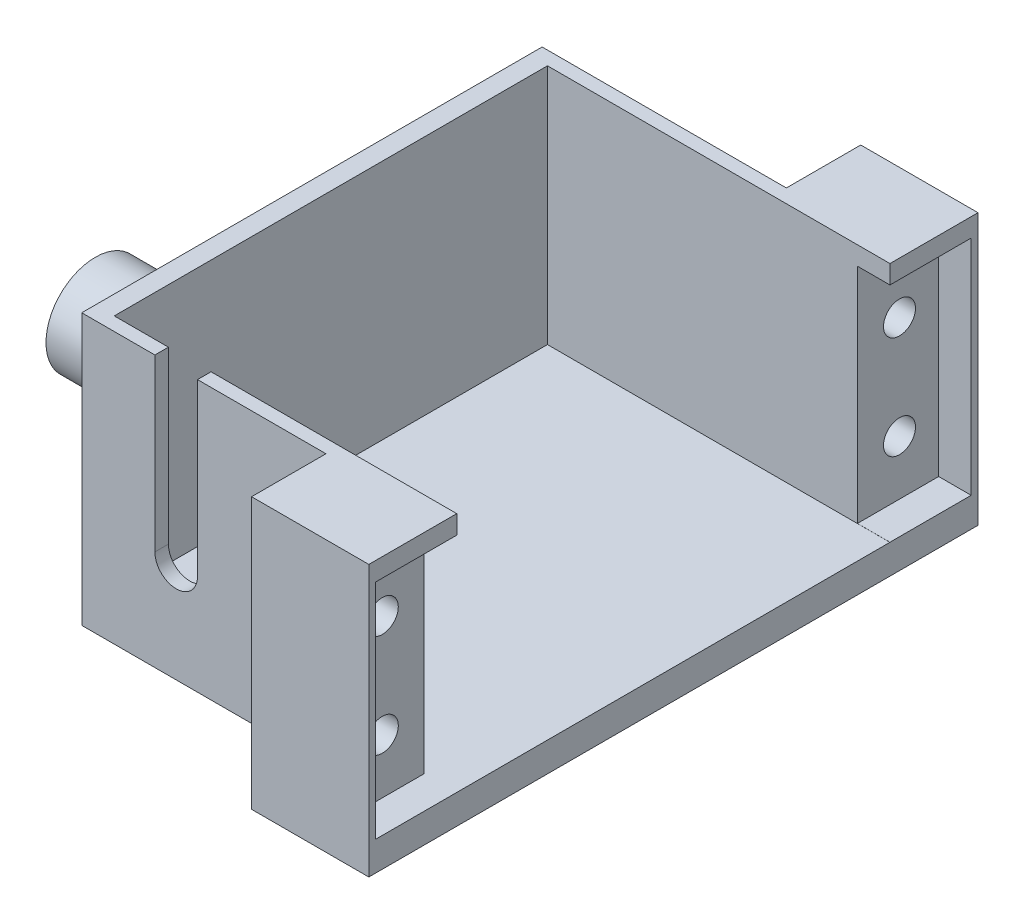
ISO-10303-21;
HEADER;
FILE_DESCRIPTION(('STEP AP214'),'2;1');
FILE_NAME('part.step','',(''),(''),'','','');
FILE_SCHEMA(('AUTOMOTIVE_DESIGN { 1 0 10303 214 1 1 1 1 }'));
ENDSEC;
DATA;
#1=APPLICATION_CONTEXT('core data for automotive mechanical design processes');
#2=APPLICATION_PROTOCOL_DEFINITION('international standard','automotive_design',2000,#1);
#3=PRODUCT_CONTEXT('',#1,'mechanical');
#4=PRODUCT('Part','Part','',(#3));
#5=PRODUCT_RELATED_PRODUCT_CATEGORY('part','',(#4));
#6=PRODUCT_DEFINITION_FORMATION('','',#4);
#7=PRODUCT_DEFINITION_CONTEXT('part definition',#1,'design');
#8=PRODUCT_DEFINITION('design','',#6,#7);
#9=PRODUCT_DEFINITION_SHAPE('','',#8);
#10=(LENGTH_UNIT() NAMED_UNIT(*) SI_UNIT(.MILLI.,.METRE.));
#11=(NAMED_UNIT(*) PLANE_ANGLE_UNIT() SI_UNIT($,.RADIAN.));
#12=(NAMED_UNIT(*) SI_UNIT($,.STERADIAN.) SOLID_ANGLE_UNIT());
#13=UNCERTAINTY_MEASURE_WITH_UNIT(LENGTH_MEASURE(1.E-05),#10,'distance_accuracy_value','');
#14=(GEOMETRIC_REPRESENTATION_CONTEXT(3) GLOBAL_UNCERTAINTY_ASSIGNED_CONTEXT((#13)) GLOBAL_UNIT_ASSIGNED_CONTEXT((#10,
#11,#12)) REPRESENTATION_CONTEXT('',''));
#15=CARTESIAN_POINT('',(0.,0.,0.));
#16=DIRECTION('',(0.,0.,1.));
#17=DIRECTION('',(1.,0.,0.));
#18=AXIS2_PLACEMENT_3D('',#15,#16,#17);
#19=CARTESIAN_POINT('',(-16.956,17.525,-24.26));
#20=DIRECTION('',(1.,0.,0.));
#21=DIRECTION('',(0.,0.,-1.));
#22=AXIS2_PLACEMENT_3D('',#19,#20,#21);
#23=CYLINDRICAL_SURFACE('',#22,1.5);
#24=CARTESIAN_POINT('',(13.905,17.525,-24.26));
#25=DIRECTION('',(1.,0.,0.));
#26=DIRECTION('',(0.,0.,-1.));
#27=AXIS2_PLACEMENT_3D('',#24,#25,#26);
#28=CIRCLE('',#27,1.5);
#29=CARTESIAN_POINT('',(13.905,17.525,-25.76));
#30=VERTEX_POINT('',#29);
#31=EDGE_CURVE('E856',#30,#30,#28,.F.);
#32=ORIENTED_EDGE('',*,*,#31,.F.);
#33=EDGE_LOOP('',(#32));
#34=FACE_BOUND('',#33,.T.);
#35=CARTESIAN_POINT('',(8.255,17.525,-24.26));
#36=DIRECTION('',(-1.,0.,0.));
#37=DIRECTION('',(0.,0.,1.));
#38=AXIS2_PLACEMENT_3D('',#35,#36,#37);
#39=CIRCLE('',#38,1.5);
#40=CARTESIAN_POINT('',(8.255,17.525,-22.76));
#41=VERTEX_POINT('',#40);
#42=EDGE_CURVE('E967',#41,#41,#39,.F.);
#43=ORIENTED_EDGE('',*,*,#42,.F.);
#44=EDGE_LOOP('',(#43));
#45=FACE_BOUND('',#44,.T.);
#46=ADVANCED_FACE('F44',(#34,#45),#23,.F.);
#47=CARTESIAN_POINT('',(-16.956,7.875,24.26));
#48=DIRECTION('',(1.,0.,0.));
#49=DIRECTION('',(0.,0.,-1.));
#50=AXIS2_PLACEMENT_3D('',#47,#48,#49);
#51=CYLINDRICAL_SURFACE('',#50,1.5);
#52=CARTESIAN_POINT('',(13.905,7.875,24.26));
#53=DIRECTION('',(-1.,0.,0.));
#54=DIRECTION('',(0.,0.,1.));
#55=AXIS2_PLACEMENT_3D('',#52,#53,#54);
#56=CIRCLE('',#55,1.5);
#57=CARTESIAN_POINT('',(13.905,7.875,25.76));
#58=VERTEX_POINT('',#57);
#59=EDGE_CURVE('E848',#58,#58,#56,.F.);
#60=ORIENTED_EDGE('',*,*,#59,.T.);
#61=EDGE_LOOP('',(#60));
#62=FACE_BOUND('',#61,.T.);
#63=CARTESIAN_POINT('',(8.255,7.875,24.26));
#64=DIRECTION('',(-1.,0.,0.));
#65=DIRECTION('',(0.,0.,1.));
#66=AXIS2_PLACEMENT_3D('',#63,#64,#65);
#67=CIRCLE('',#66,1.5);
#68=CARTESIAN_POINT('',(8.255,7.875,25.76));
#69=VERTEX_POINT('',#68);
#70=EDGE_CURVE('E638',#69,#69,#67,.F.);
#71=ORIENTED_EDGE('',*,*,#70,.F.);
#72=EDGE_LOOP('',(#71));
#73=FACE_BOUND('',#72,.T.);
#74=ADVANCED_FACE('F996',(#62,#73),#51,.F.);
#75=CARTESIAN_POINT('',(0.,0.,0.));
#76=DIRECTION('',(0.,-1.,0.));
#77=DIRECTION('',(0.,0.,-1.));
#78=AXIS2_PLACEMENT_3D('',#75,#76,#77);
#79=PLANE('',#78);
#80=DIRECTION('',(0.,0.,-1.));
#81=VECTOR('',#80,1.);
#82=CARTESIAN_POINT('',(5.955,0.,28.575));
#83=LINE('',#82,#81);
#84=CARTESIAN_POINT('',(5.955,0.,28.575));
#85=VERTEX_POINT('',#84);
#86=CARTESIAN_POINT('',(5.955,0.,21.595));
#87=VERTEX_POINT('',#86);
#88=EDGE_CURVE('E736',#85,#87,#83,.T.);
#89=ORIENTED_EDGE('',*,*,#88,.T.);
#90=DIRECTION('',(-1.,0.,0.));
#91=VECTOR('',#90,1.);
#92=CARTESIAN_POINT('',(-16.955,0.,21.595));
#93=LINE('',#92,#91);
#94=CARTESIAN_POINT('',(-16.955,0.,21.595));
#95=VERTEX_POINT('',#94);
#96=EDGE_CURVE('E740',#87,#95,#93,.T.);
#97=ORIENTED_EDGE('',*,*,#96,.T.);
#98=DIRECTION('',(0.,0.,1.));
#99=VECTOR('',#98,1.);
#100=CARTESIAN_POINT('',(-16.955,0.,28.575));
#101=LINE('',#100,#99);
#102=CARTESIAN_POINT('',(-16.955,0.,-21.595));
#103=VERTEX_POINT('',#102);
#104=EDGE_CURVE('E933',#103,#95,#101,.T.);
#105=ORIENTED_EDGE('',*,*,#104,.F.);
#106=DIRECTION('',(1.,0.,0.));
#107=VECTOR('',#106,1.);
#108=CARTESIAN_POINT('',(-16.955,0.,-21.595));
#109=LINE('',#108,#107);
#110=CARTESIAN_POINT('',(5.955,0.,-21.595));
#111=VERTEX_POINT('',#110);
#112=EDGE_CURVE('E735',#103,#111,#109,.T.);
#113=ORIENTED_EDGE('',*,*,#112,.T.);
#114=DIRECTION('',(0.,0.,-1.));
#115=VECTOR('',#114,1.);
#116=CARTESIAN_POINT('',(5.955,0.,-28.575));
#117=LINE('',#116,#115);
#118=CARTESIAN_POINT('',(5.955,0.,-28.575));
#119=VERTEX_POINT('',#118);
#120=EDGE_CURVE('E741',#111,#119,#117,.T.);
#121=ORIENTED_EDGE('',*,*,#120,.T.);
#122=DIRECTION('',(-1.,0.,0.));
#123=VECTOR('',#122,1.);
#124=CARTESIAN_POINT('',(-16.955,0.,-28.575));
#125=LINE('',#124,#123);
#126=CARTESIAN_POINT('',(16.955,0.,-28.575));
#127=VERTEX_POINT('',#126);
#128=EDGE_CURVE('E929',#127,#119,#125,.T.);
#129=ORIENTED_EDGE('',*,*,#128,.F.);
#130=DIRECTION('',(0.,0.,-1.));
#131=VECTOR('',#130,1.);
#132=CARTESIAN_POINT('',(16.955,0.,28.575));
#133=LINE('',#132,#131);
#134=CARTESIAN_POINT('',(16.955,0.,28.575));
#135=VERTEX_POINT('',#134);
#136=EDGE_CURVE('E896',#135,#127,#133,.T.);
#137=ORIENTED_EDGE('',*,*,#136,.F.);
#138=DIRECTION('',(1.,0.,0.));
#139=VECTOR('',#138,1.);
#140=CARTESIAN_POINT('',(-16.955,0.,28.575));
#141=LINE('',#140,#139);
#142=EDGE_CURVE('E937',#85,#135,#141,.T.);
#143=ORIENTED_EDGE('',*,*,#142,.F.);
#144=EDGE_LOOP('',(#89,#97,#105,#113,#121,#129,#137,#143));
#145=FACE_BOUND('',#144,.T.);
#146=DIRECTION('',(-1.,0.,0.));
#147=VECTOR('',#146,1.);
#148=CARTESIAN_POINT('',(-4.,0.,4.));
#149=LINE('',#148,#147);
#150=CARTESIAN_POINT('',(4.,0.,4.));
#151=VERTEX_POINT('',#150);
#152=CARTESIAN_POINT('',(-4.,0.,4.));
#153=VERTEX_POINT('',#152);
#154=EDGE_CURVE('E674',#151,#153,#149,.T.);
#155=ORIENTED_EDGE('',*,*,#154,.F.);
#156=DIRECTION('',(0.,0.,1.));
#157=VECTOR('',#156,1.);
#158=CARTESIAN_POINT('',(4.,0.,-4.));
#159=LINE('',#158,#157);
#160=CARTESIAN_POINT('',(4.,0.,-4.));
#161=VERTEX_POINT('',#160);
#162=EDGE_CURVE('E670',#161,#151,#159,.T.);
#163=ORIENTED_EDGE('',*,*,#162,.F.);
#164=DIRECTION('',(1.,0.,0.));
#165=VECTOR('',#164,1.);
#166=CARTESIAN_POINT('',(-4.,0.,-4.));
#167=LINE('',#166,#165);
#168=CARTESIAN_POINT('',(-4.,0.,-4.));
#169=VERTEX_POINT('',#168);
#170=EDGE_CURVE('E660',#169,#161,#167,.T.);
#171=ORIENTED_EDGE('',*,*,#170,.F.);
#172=DIRECTION('',(0.,0.,-1.));
#173=VECTOR('',#172,1.);
#174=CARTESIAN_POINT('',(-4.,0.,-4.));
#175=LINE('',#174,#173);
#176=EDGE_CURVE('E677',#153,#169,#175,.T.);
#177=ORIENTED_EDGE('',*,*,#176,.F.);
#178=EDGE_LOOP('',(#155,#163,#171,#177));
#179=FACE_BOUND('',#178,.T.);
#180=ADVANCED_FACE('F1003',(#145,#179),#79,.T.);
#181=CARTESIAN_POINT('',(0.,25.4,0.));
#182=DIRECTION('',(0.,-1.,0.));
#183=DIRECTION('',(0.,0.,-1.));
#184=AXIS2_PLACEMENT_3D('',#181,#182,#183);
#185=PLANE('',#184);
#186=DIRECTION('',(1.,0.,0.));
#187=VECTOR('',#186,1.);
#188=CARTESIAN_POINT('',(-15.175,25.4,20.325));
#189=LINE('',#188,#187);
#190=CARTESIAN_POINT('',(-6.095,25.4,20.325));
#191=VERTEX_POINT('',#190);
#192=CARTESIAN_POINT('',(16.955,25.4,20.325));
#193=VERTEX_POINT('',#192);
#194=EDGE_CURVE('E897',#191,#193,#189,.T.);
#195=ORIENTED_EDGE('',*,*,#194,.F.);
#196=DIRECTION('',(0.,0.,1.));
#197=VECTOR('',#196,1.);
#198=CARTESIAN_POINT('',(-6.095,25.4,-28.576));
#199=LINE('',#198,#197);
#200=CARTESIAN_POINT('',(-6.095,25.4,21.595));
#201=VERTEX_POINT('',#200);
#202=EDGE_CURVE('E721',#191,#201,#199,.T.);
#203=ORIENTED_EDGE('',*,*,#202,.T.);
#204=DIRECTION('',(-1.,0.,0.));
#205=VECTOR('',#204,1.);
#206=CARTESIAN_POINT('',(-16.955,25.4,21.595));
#207=LINE('',#206,#205);
#208=CARTESIAN_POINT('',(5.955,25.4,21.595));
#209=VERTEX_POINT('',#208);
#210=EDGE_CURVE('E750',#209,#201,#207,.T.);
#211=ORIENTED_EDGE('',*,*,#210,.F.);
#212=DIRECTION('',(0.,0.,-1.));
#213=VECTOR('',#212,1.);
#214=CARTESIAN_POINT('',(5.955,25.4,28.575));
#215=LINE('',#214,#213);
#216=CARTESIAN_POINT('',(5.955,25.4,28.575));
#217=VERTEX_POINT('',#216);
#218=EDGE_CURVE('E745',#217,#209,#215,.T.);
#219=ORIENTED_EDGE('',*,*,#218,.F.);
#220=DIRECTION('',(1.,0.,0.));
#221=VECTOR('',#220,1.);
#222=CARTESIAN_POINT('',(-16.955,25.4,28.575));
#223=LINE('',#222,#221);
#224=CARTESIAN_POINT('',(16.955,25.4,28.575));
#225=VERTEX_POINT('',#224);
#226=EDGE_CURVE('E922',#217,#225,#223,.T.);
#227=ORIENTED_EDGE('',*,*,#226,.T.);
#228=DIRECTION('',(0.,0.,-1.));
#229=VECTOR('',#228,1.);
#230=CARTESIAN_POINT('',(16.955,25.4,28.575));
#231=LINE('',#230,#229);
#232=EDGE_CURVE('E909',#225,#193,#231,.T.);
#233=ORIENTED_EDGE('',*,*,#232,.T.);
#234=EDGE_LOOP('',(#195,#203,#211,#219,#227,#233));
#235=FACE_BOUND('',#234,.T.);
#236=ADVANCED_FACE('F1020',(#235),#185,.F.);
#237=CARTESIAN_POINT('',(-16.956,7.875,-24.26));
#238=DIRECTION('',(1.,0.,0.));
#239=DIRECTION('',(0.,0.,-1.));
#240=AXIS2_PLACEMENT_3D('',#237,#238,#239);
#241=CYLINDRICAL_SURFACE('',#240,1.5);
#242=CARTESIAN_POINT('',(8.255,7.875,-24.26));
#243=DIRECTION('',(1.,0.,0.));
#244=DIRECTION('',(0.,0.,-1.));
#245=AXIS2_PLACEMENT_3D('',#242,#243,#244);
#246=CIRCLE('',#245,1.5);
#247=CARTESIAN_POINT('',(8.255,7.875,-25.76));
#248=VERTEX_POINT('',#247);
#249=EDGE_CURVE('E48',#248,#248,#246,.F.);
#250=ORIENTED_EDGE('',*,*,#249,.T.);
#251=EDGE_LOOP('',(#250));
#252=FACE_BOUND('',#251,.T.);
#253=CARTESIAN_POINT('',(13.905,7.875,-24.26));
#254=DIRECTION('',(1.,0.,0.));
#255=DIRECTION('',(0.,0.,-1.));
#256=AXIS2_PLACEMENT_3D('',#253,#254,#255);
#257=CIRCLE('',#256,1.5);
#258=CARTESIAN_POINT('',(13.905,7.875,-25.76));
#259=VERTEX_POINT('',#258);
#260=EDGE_CURVE('E860',#259,#259,#257,.F.);
#261=ORIENTED_EDGE('',*,*,#260,.F.);
#262=EDGE_LOOP('',(#261));
#263=FACE_BOUND('',#262,.T.);
#264=ADVANCED_FACE('F976',(#252,#263),#241,.F.);
#265=CARTESIAN_POINT('',(16.955,25.4,28.575));
#266=DIRECTION('',(-1.,0.,0.));
#267=DIRECTION('',(0.,0.,1.));
#268=AXIS2_PLACEMENT_3D('',#265,#266,#267);
#269=PLANE('',#268);
#270=DIRECTION('',(0.,0.,-1.));
#271=VECTOR('',#270,1.);
#272=CARTESIAN_POINT('',(16.955,2.75,20.325));
#273=LINE('',#272,#271);
#274=CARTESIAN_POINT('',(16.955,2.75,27.935));
#275=VERTEX_POINT('',#274);
#276=CARTESIAN_POINT('',(16.955,2.75,-20.315));
#277=VERTEX_POINT('',#276);
#278=EDGE_CURVE('E885',#275,#277,#273,.T.);
#279=ORIENTED_EDGE('',*,*,#278,.F.);
#280=DIRECTION('',(0.,-1.,0.));
#281=VECTOR('',#280,1.);
#282=CARTESIAN_POINT('',(16.955,23.65,27.935));
#283=LINE('',#282,#281);
#284=CARTESIAN_POINT('',(16.955,23.65,27.935));
#285=VERTEX_POINT('',#284);
#286=EDGE_CURVE('E797',#285,#275,#283,.T.);
#287=ORIENTED_EDGE('',*,*,#286,.F.);
#288=DIRECTION('',(0.,0.,1.));
#289=VECTOR('',#288,1.);
#290=CARTESIAN_POINT('',(16.955,23.65,20.315));
#291=LINE('',#290,#289);
#292=CARTESIAN_POINT('',(16.955,23.65,20.325));
#293=VERTEX_POINT('',#292);
#294=EDGE_CURVE('E805',#293,#285,#291,.T.);
#295=ORIENTED_EDGE('',*,*,#294,.F.);
#296=DIRECTION('',(0.,-1.,0.));
#297=VECTOR('',#296,1.);
#298=CARTESIAN_POINT('',(16.955,25.4,20.325));
#299=LINE('',#298,#297);
#300=EDGE_CURVE('E864',#193,#293,#299,.T.);
#301=ORIENTED_EDGE('',*,*,#300,.F.);
#302=ORIENTED_EDGE('',*,*,#232,.F.);
#303=DIRECTION('',(0.,-1.,0.));
#304=VECTOR('',#303,1.);
#305=CARTESIAN_POINT('',(16.955,25.4,28.575));
#306=LINE('',#305,#304);
#307=EDGE_CURVE('E925',#225,#135,#306,.T.);
#308=ORIENTED_EDGE('',*,*,#307,.T.);
#309=ORIENTED_EDGE('',*,*,#136,.T.);
#310=DIRECTION('',(0.,-1.,0.));
#311=VECTOR('',#310,1.);
#312=CARTESIAN_POINT('',(16.955,25.4,-28.575));
#313=LINE('',#312,#311);
#314=CARTESIAN_POINT('',(16.955,25.4,-28.575));
#315=VERTEX_POINT('',#314);
#316=EDGE_CURVE('E943',#315,#127,#313,.T.);
#317=ORIENTED_EDGE('',*,*,#316,.F.);
#318=CARTESIAN_POINT('',(16.955,25.4,-20.315));
#319=VERTEX_POINT('',#318);
#320=EDGE_CURVE('E914',#319,#315,#231,.T.);
#321=ORIENTED_EDGE('',*,*,#320,.F.);
#322=DIRECTION('',(0.,1.,0.));
#323=VECTOR('',#322,1.);
#324=CARTESIAN_POINT('',(16.955,25.4,-20.315));
#325=LINE('',#324,#323);
#326=CARTESIAN_POINT('',(16.955,23.6579998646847,-20.315));
#327=VERTEX_POINT('',#326);
#328=EDGE_CURVE('E888',#327,#319,#325,.T.);
#329=ORIENTED_EDGE('',*,*,#328,.F.);
#330=DIRECTION('',(0.,-0.000393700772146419,0.999999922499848));
#331=VECTOR('',#330,1.);
#332=CARTESIAN_POINT('',(16.955,23.6579961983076,-20.3056874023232));
#333=LINE('',#332,#331);
#334=CARTESIAN_POINT('',(16.955,23.6609961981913,-27.925686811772));
#335=VERTEX_POINT('',#334);
#336=EDGE_CURVE('E827',#335,#327,#333,.T.);
#337=ORIENTED_EDGE('',*,*,#336,.F.);
#338=DIRECTION('',(0.,0.999999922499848,0.000393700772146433));
#339=VECTOR('',#338,1.);
#340=CARTESIAN_POINT('',(16.955,23.6609961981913,-27.925686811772));
#341=LINE('',#340,#339);
#342=CARTESIAN_POINT('',(16.955,2.76099781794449,-27.9339151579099));
#343=VERTEX_POINT('',#342);
#344=EDGE_CURVE('E830',#343,#335,#341,.T.);
#345=ORIENTED_EDGE('',*,*,#344,.F.);
#346=DIRECTION('',(0.,0.000393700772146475,-0.999999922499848));
#347=VECTOR('',#346,1.);
#348=CARTESIAN_POINT('',(16.955,2.75799781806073,-20.313915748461));
#349=LINE('',#348,#347);
#350=CARTESIAN_POINT('',(16.955,2.75799824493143,-20.315));
#351=VERTEX_POINT('',#350);
#352=EDGE_CURVE('E808',#351,#343,#349,.T.);
#353=ORIENTED_EDGE('',*,*,#352,.F.);
#354=EDGE_CURVE('E870',#277,#351,#325,.T.);
#355=ORIENTED_EDGE('',*,*,#354,.F.);
#356=EDGE_LOOP('',(#279,#287,#295,#301,#302,#308,#309,#317,#321,#329,#337,#345,#353,#355));
#357=FACE_BOUND('',#356,.T.);
#358=ADVANCED_FACE('F46',(#357),#269,.F.);
#359=CARTESIAN_POINT('',(-16.955,25.4,-28.575));
#360=DIRECTION('',(0.,0.,1.));
#361=DIRECTION('',(1.,0.,0.));
#362=AXIS2_PLACEMENT_3D('',#359,#360,#361);
#363=PLANE('',#362);
#364=ORIENTED_EDGE('',*,*,#128,.T.);
#365=DIRECTION('',(0.,1.,0.));
#366=VECTOR('',#365,1.);
#367=CARTESIAN_POINT('',(5.955,-0.001000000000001,-28.575));
#368=LINE('',#367,#366);
#369=CARTESIAN_POINT('',(5.955,25.4,-28.575));
#370=VERTEX_POINT('',#369);
#371=EDGE_CURVE('E771',#119,#370,#368,.T.);
#372=ORIENTED_EDGE('',*,*,#371,.T.);
#373=DIRECTION('',(-1.,0.,0.));
#374=VECTOR('',#373,1.);
#375=CARTESIAN_POINT('',(-16.955,25.4,-28.575));
#376=LINE('',#375,#374);
#377=EDGE_CURVE('E913',#315,#370,#376,.T.);
#378=ORIENTED_EDGE('',*,*,#377,.F.);
#379=ORIENTED_EDGE('',*,*,#316,.T.);
#380=EDGE_LOOP('',(#364,#372,#378,#379));
#381=FACE_BOUND('',#380,.T.);
#382=ADVANCED_FACE('F1029',(#381),#363,.F.);
#383=CARTESIAN_POINT('',(-16.955,25.4,28.575));
#384=DIRECTION('',(1.,0.,0.));
#385=DIRECTION('',(0.,0.,-1.));
#386=AXIS2_PLACEMENT_3D('',#383,#384,#385);
#387=PLANE('',#386);
#388=CARTESIAN_POINT('',(-16.955,14.65,10.325));
#389=DIRECTION('',(1.,0.,0.));
#390=DIRECTION('',(0.,0.,-1.));
#391=AXIS2_PLACEMENT_3D('',#388,#389,#390);
#392=CIRCLE('',#391,4.625);
#393=CARTESIAN_POINT('',(-16.955,14.65,5.70000000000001));
#394=VERTEX_POINT('',#393);
#395=EDGE_CURVE('E11',#394,#394,#392,.F.);
#396=ORIENTED_EDGE('',*,*,#395,.F.);
#397=EDGE_LOOP('',(#396));
#398=FACE_BOUND('',#397,.T.);
#399=ORIENTED_EDGE('',*,*,#104,.T.);
#400=DIRECTION('',(0.,1.,0.));
#401=VECTOR('',#400,1.);
#402=CARTESIAN_POINT('',(-16.955,-0.001000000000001,21.595));
#403=LINE('',#402,#401);
#404=CARTESIAN_POINT('',(-16.955,25.4,21.595));
#405=VERTEX_POINT('',#404);
#406=EDGE_CURVE('E755',#95,#405,#403,.T.);
#407=ORIENTED_EDGE('',*,*,#406,.T.);
#408=DIRECTION('',(0.,0.,1.));
#409=VECTOR('',#408,1.);
#410=CARTESIAN_POINT('',(-16.955,25.4,28.575));
#411=LINE('',#410,#409);
#412=CARTESIAN_POINT('',(-16.955,25.4,-21.595));
#413=VERTEX_POINT('',#412);
#414=EDGE_CURVE('E918',#413,#405,#411,.T.);
#415=ORIENTED_EDGE('',*,*,#414,.F.);
#416=DIRECTION('',(0.,1.,0.));
#417=VECTOR('',#416,1.);
#418=CARTESIAN_POINT('',(-16.955,-0.001000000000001,-21.595));
#419=LINE('',#418,#417);
#420=EDGE_CURVE('E772',#103,#413,#419,.T.);
#421=ORIENTED_EDGE('',*,*,#420,.F.);
#422=EDGE_LOOP('',(#399,#407,#415,#421));
#423=FACE_BOUND('',#422,.T.);
#424=ADVANCED_FACE('F1026',(#398,#423),#387,.F.);
#425=CARTESIAN_POINT('',(-16.955,25.4,28.575));
#426=DIRECTION('',(0.,0.,-1.));
#427=DIRECTION('',(-1.,0.,0.));
#428=AXIS2_PLACEMENT_3D('',#425,#426,#427);
#429=PLANE('',#428);
#430=ORIENTED_EDGE('',*,*,#226,.F.);
#431=DIRECTION('',(0.,1.,0.));
#432=VECTOR('',#431,1.);
#433=CARTESIAN_POINT('',(5.955,-0.001000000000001,28.575));
#434=LINE('',#433,#432);
#435=EDGE_CURVE('E754',#85,#217,#434,.T.);
#436=ORIENTED_EDGE('',*,*,#435,.F.);
#437=ORIENTED_EDGE('',*,*,#142,.T.);
#438=ORIENTED_EDGE('',*,*,#307,.F.);
#439=EDGE_LOOP('',(#430,#436,#437,#438));
#440=FACE_BOUND('',#439,.T.);
#441=ADVANCED_FACE('F1018',(#440),#429,.F.);
#442=CARTESIAN_POINT('',(-10.095,25.4,21.595));
#443=VERTEX_POINT('',#442);
#444=EDGE_CURVE('E749',#443,#405,#207,.T.);
#445=ORIENTED_EDGE('',*,*,#444,.F.);
#446=DIRECTION('',(0.,0.,1.));
#447=VECTOR('',#446,1.);
#448=CARTESIAN_POINT('',(-10.095,25.4,-28.576));
#449=LINE('',#448,#447);
#450=CARTESIAN_POINT('',(-10.095,25.4,20.325));
#451=VERTEX_POINT('',#450);
#452=EDGE_CURVE('E696',#451,#443,#449,.T.);
#453=ORIENTED_EDGE('',*,*,#452,.F.);
#454=CARTESIAN_POINT('',(-15.175,25.4,20.325));
#455=VERTEX_POINT('',#454);
#456=EDGE_CURVE('E892',#455,#451,#189,.T.);
#457=ORIENTED_EDGE('',*,*,#456,.F.);
#458=DIRECTION('',(0.,0.,1.));
#459=VECTOR('',#458,1.);
#460=CARTESIAN_POINT('',(-15.175,25.4,20.325));
#461=LINE('',#460,#459);
#462=CARTESIAN_POINT('',(-15.175,25.4,-20.315));
#463=VERTEX_POINT('',#462);
#464=EDGE_CURVE('E877',#463,#455,#461,.T.);
#465=ORIENTED_EDGE('',*,*,#464,.F.);
#466=DIRECTION('',(1.,0.,0.));
#467=VECTOR('',#466,1.);
#468=CARTESIAN_POINT('',(-15.175,25.4,-20.315));
#469=LINE('',#468,#467);
#470=EDGE_CURVE('E898',#463,#319,#469,.T.);
#471=ORIENTED_EDGE('',*,*,#470,.T.);
#472=ORIENTED_EDGE('',*,*,#320,.T.);
#473=ORIENTED_EDGE('',*,*,#377,.T.);
#474=DIRECTION('',(0.,0.,-1.));
#475=VECTOR('',#474,1.);
#476=CARTESIAN_POINT('',(5.955,25.4,-28.575));
#477=LINE('',#476,#475);
#478=CARTESIAN_POINT('',(5.955,25.4,-21.595));
#479=VERTEX_POINT('',#478);
#480=EDGE_CURVE('E775',#479,#370,#477,.T.);
#481=ORIENTED_EDGE('',*,*,#480,.F.);
#482=DIRECTION('',(1.,0.,0.));
#483=VECTOR('',#482,1.);
#484=CARTESIAN_POINT('',(-16.955,25.4,-21.595));
#485=LINE('',#484,#483);
#486=EDGE_CURVE('E786',#413,#479,#485,.T.);
#487=ORIENTED_EDGE('',*,*,#486,.F.);
#488=ORIENTED_EDGE('',*,*,#414,.T.);
#489=EDGE_LOOP('',(#445,#453,#457,#465,#471,#472,#473,#481,#487,#488));
#490=FACE_BOUND('',#489,.T.);
#491=ADVANCED_FACE('F1014',(#490),#185,.F.);
#492=CARTESIAN_POINT('',(-16.956,17.525,24.26));
#493=DIRECTION('',(1.,0.,0.));
#494=DIRECTION('',(0.,0.,-1.));
#495=AXIS2_PLACEMENT_3D('',#492,#493,#494);
#496=CYLINDRICAL_SURFACE('',#495,1.5);
#497=CARTESIAN_POINT('',(8.255,17.525,24.26));
#498=DIRECTION('',(1.,0.,0.));
#499=DIRECTION('',(0.,0.,-1.));
#500=AXIS2_PLACEMENT_3D('',#497,#498,#499);
#501=CIRCLE('',#500,1.5);
#502=CARTESIAN_POINT('',(8.255,17.525,22.76));
#503=VERTEX_POINT('',#502);
#504=EDGE_CURVE('E964',#503,#503,#501,.F.);
#505=ORIENTED_EDGE('',*,*,#504,.T.);
#506=EDGE_LOOP('',(#505));
#507=FACE_BOUND('',#506,.T.);
#508=CARTESIAN_POINT('',(13.905,17.525,24.26));
#509=DIRECTION('',(-1.,0.,0.));
#510=DIRECTION('',(0.,0.,1.));
#511=AXIS2_PLACEMENT_3D('',#508,#509,#510);
#512=CIRCLE('',#511,1.5);
#513=CARTESIAN_POINT('',(13.905,17.525,25.76));
#514=VERTEX_POINT('',#513);
#515=EDGE_CURVE('E852',#514,#514,#512,.F.);
#516=ORIENTED_EDGE('',*,*,#515,.T.);
#517=EDGE_LOOP('',(#516));
#518=FACE_BOUND('',#517,.T.);
#519=ADVANCED_FACE('F1010',(#507,#518),#496,.F.);
#520=CARTESIAN_POINT('',(-15.175,25.4,20.325));
#521=DIRECTION('',(0.,0.,1.));
#522=DIRECTION('',(0.,-1.,0.));
#523=AXIS2_PLACEMENT_3D('',#520,#521,#522);
#524=PLANE('',#523);
#525=CARTESIAN_POINT('',(-8.095,9.4,20.325));
#526=DIRECTION('',(0.,0.,1.));
#527=DIRECTION('',(0.,-1.,0.));
#528=AXIS2_PLACEMENT_3D('',#525,#526,#527);
#529=CIRCLE('',#528,2.);
#530=CARTESIAN_POINT('',(-6.095,9.4,20.325));
#531=VERTEX_POINT('',#530);
#532=CARTESIAN_POINT('',(-10.095,9.4,20.325));
#533=VERTEX_POINT('',#532);
#534=EDGE_CURVE('E701',#531,#533,#529,.F.);
#535=ORIENTED_EDGE('',*,*,#534,.F.);
#536=DIRECTION('',(0.,-1.,0.));
#537=VECTOR('',#536,1.);
#538=CARTESIAN_POINT('',(-6.095,9.39999999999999,20.325));
#539=LINE('',#538,#537);
#540=EDGE_CURVE('E705',#191,#531,#539,.T.);
#541=ORIENTED_EDGE('',*,*,#540,.F.);
#542=ORIENTED_EDGE('',*,*,#194,.T.);
#543=ORIENTED_EDGE('',*,*,#300,.T.);
#544=DIRECTION('',(-1.,0.,0.));
#545=VECTOR('',#544,1.);
#546=CARTESIAN_POINT('',(-15.175,23.65,20.325));
#547=LINE('',#546,#545);
#548=CARTESIAN_POINT('',(13.905,23.65,20.325));
#549=VERTEX_POINT('',#548);
#550=EDGE_CURVE('E54',#293,#549,#547,.T.);
#551=ORIENTED_EDGE('',*,*,#550,.T.);
#552=DIRECTION('',(0.,-1.,0.));
#553=VECTOR('',#552,1.);
#554=CARTESIAN_POINT('',(13.905,25.4,20.325));
#555=LINE('',#554,#553);
#556=CARTESIAN_POINT('',(13.905,2.75,20.325));
#557=VERTEX_POINT('',#556);
#558=EDGE_CURVE('E816',#549,#557,#555,.T.);
#559=ORIENTED_EDGE('',*,*,#558,.T.);
#560=DIRECTION('',(1.,0.,0.));
#561=VECTOR('',#560,1.);
#562=CARTESIAN_POINT('',(-15.175,2.75,20.325));
#563=LINE('',#562,#561);
#564=CARTESIAN_POINT('',(-15.175,2.75,20.325));
#565=VERTEX_POINT('',#564);
#566=EDGE_CURVE('E881',#565,#557,#563,.T.);
#567=ORIENTED_EDGE('',*,*,#566,.F.);
#568=DIRECTION('',(0.,-1.,0.));
#569=VECTOR('',#568,1.);
#570=CARTESIAN_POINT('',(-15.175,25.4,20.325));
#571=LINE('',#570,#569);
#572=EDGE_CURVE('E865',#455,#565,#571,.T.);
#573=ORIENTED_EDGE('',*,*,#572,.F.);
#574=ORIENTED_EDGE('',*,*,#456,.T.);
#575=DIRECTION('',(0.,1.,0.));
#576=VECTOR('',#575,1.);
#577=CARTESIAN_POINT('',(-10.095,25.4,20.325));
#578=LINE('',#577,#576);
#579=EDGE_CURVE('E697',#533,#451,#578,.T.);
#580=ORIENTED_EDGE('',*,*,#579,.F.);
#581=EDGE_LOOP('',(#535,#541,#542,#543,#551,#559,#567,#573,#574,#580));
#582=FACE_BOUND('',#581,.T.);
#583=ADVANCED_FACE('F1013',(#582),#524,.F.);
#584=CARTESIAN_POINT('',(-15.175,25.4,-20.315));
#585=DIRECTION('',(0.,0.,-1.));
#586=DIRECTION('',(-1.,0.,0.));
#587=AXIS2_PLACEMENT_3D('',#584,#585,#586);
#588=PLANE('',#587);
#589=DIRECTION('',(0.,-1.,0.));
#590=VECTOR('',#589,1.);
#591=CARTESIAN_POINT('',(13.905,25.4,-20.315));
#592=LINE('',#591,#590);
#593=CARTESIAN_POINT('',(13.905,23.6579998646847,-20.315));
#594=VERTEX_POINT('',#593);
#595=CARTESIAN_POINT('',(13.905,2.75799824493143,-20.315));
#596=VERTEX_POINT('',#595);
#597=EDGE_CURVE('E947',#594,#596,#592,.T.);
#598=ORIENTED_EDGE('',*,*,#597,.F.);
#599=DIRECTION('',(1.,0.,0.));
#600=VECTOR('',#599,1.);
#601=CARTESIAN_POINT('',(-15.175,23.6579998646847,-20.315));
#602=LINE('',#601,#600);
#603=EDGE_CURVE('E954',#594,#327,#602,.T.);
#604=ORIENTED_EDGE('',*,*,#603,.T.);
#605=ORIENTED_EDGE('',*,*,#328,.T.);
#606=ORIENTED_EDGE('',*,*,#470,.F.);
#607=DIRECTION('',(0.,1.,0.));
#608=VECTOR('',#607,1.);
#609=CARTESIAN_POINT('',(-15.175,25.4,-20.315));
#610=LINE('',#609,#608);
#611=CARTESIAN_POINT('',(-15.175,2.75,-20.315));
#612=VERTEX_POINT('',#611);
#613=EDGE_CURVE('E874',#612,#463,#610,.T.);
#614=ORIENTED_EDGE('',*,*,#613,.F.);
#615=DIRECTION('',(1.,0.,0.));
#616=VECTOR('',#615,1.);
#617=CARTESIAN_POINT('',(-15.175,2.75,-20.315));
#618=LINE('',#617,#616);
#619=EDGE_CURVE('E902',#612,#277,#618,.T.);
#620=ORIENTED_EDGE('',*,*,#619,.T.);
#621=ORIENTED_EDGE('',*,*,#354,.T.);
#622=DIRECTION('',(-1.,0.,0.));
#623=VECTOR('',#622,1.);
#624=CARTESIAN_POINT('',(-15.175,2.75799824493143,-20.315));
#625=LINE('',#624,#623);
#626=EDGE_CURVE('E950',#351,#596,#625,.T.);
#627=ORIENTED_EDGE('',*,*,#626,.T.);
#628=EDGE_LOOP('',(#598,#604,#605,#606,#614,#620,#621,#627));
#629=FACE_BOUND('',#628,.T.);
#630=ADVANCED_FACE('F1205',(#629),#588,.F.);
#631=CARTESIAN_POINT('',(-15.175,2.75,20.325));
#632=DIRECTION('',(0.,-1.,0.));
#633=DIRECTION('',(0.,0.,-1.));
#634=AXIS2_PLACEMENT_3D('',#631,#632,#633);
#635=PLANE('',#634);
#636=ORIENTED_EDGE('',*,*,#278,.T.);
#637=ORIENTED_EDGE('',*,*,#619,.F.);
#638=DIRECTION('',(0.,0.,-1.));
#639=VECTOR('',#638,1.);
#640=CARTESIAN_POINT('',(-15.175,2.75,20.325));
#641=LINE('',#640,#639);
#642=EDGE_CURVE('E869',#565,#612,#641,.T.);
#643=ORIENTED_EDGE('',*,*,#642,.F.);
#644=ORIENTED_EDGE('',*,*,#566,.T.);
#645=DIRECTION('',(0.,0.,-1.));
#646=VECTOR('',#645,1.);
#647=CARTESIAN_POINT('',(13.905,2.75,20.315));
#648=LINE('',#647,#646);
#649=CARTESIAN_POINT('',(13.905,2.75,27.935));
#650=VERTEX_POINT('',#649);
#651=EDGE_CURVE('E801',#650,#557,#648,.T.);
#652=ORIENTED_EDGE('',*,*,#651,.F.);
#653=DIRECTION('',(1.,0.,0.));
#654=VECTOR('',#653,1.);
#655=CARTESIAN_POINT('',(13.905,2.75,27.935));
#656=LINE('',#655,#654);
#657=EDGE_CURVE('E812',#650,#275,#656,.T.);
#658=ORIENTED_EDGE('',*,*,#657,.T.);
#659=EDGE_LOOP('',(#636,#637,#643,#644,#652,#658));
#660=FACE_BOUND('',#659,.T.);
#661=ADVANCED_FACE('F1222',(#660),#635,.F.);
#662=CARTESIAN_POINT('',(-15.175,0.,0.));
#663=DIRECTION('',(1.,0.,0.));
#664=DIRECTION('',(0.,0.,-1.));
#665=AXIS2_PLACEMENT_3D('',#662,#663,#664);
#666=PLANE('',#665);
#667=ORIENTED_EDGE('',*,*,#572,.T.);
#668=ORIENTED_EDGE('',*,*,#642,.T.);
#669=ORIENTED_EDGE('',*,*,#613,.T.);
#670=ORIENTED_EDGE('',*,*,#464,.T.);
#671=EDGE_LOOP('',(#667,#668,#669,#670));
#672=FACE_BOUND('',#671,.T.);
#673=ADVANCED_FACE('F1200',(#672),#666,.T.);
#674=CARTESIAN_POINT('',(13.905,23.6579961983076,-20.3056874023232));
#675=DIRECTION('',(0.,0.999999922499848,0.000393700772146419));
#676=DIRECTION('',(0.,-0.000393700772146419,0.999999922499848));
#677=AXIS2_PLACEMENT_3D('',#674,#675,#676);
#678=PLANE('',#677);
#679=DIRECTION('',(0.,-0.000393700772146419,0.999999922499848));
#680=VECTOR('',#679,1.);
#681=CARTESIAN_POINT('',(13.905,23.6579961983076,-20.3056874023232));
#682=LINE('',#681,#680);
#683=CARTESIAN_POINT('',(13.905,23.6609961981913,-27.925686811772));
#684=VERTEX_POINT('',#683);
#685=EDGE_CURVE('E824',#684,#594,#682,.T.);
#686=ORIENTED_EDGE('',*,*,#685,.F.);
#687=DIRECTION('',(1.,0.,0.));
#688=VECTOR('',#687,1.);
#689=CARTESIAN_POINT('',(13.905,23.6609961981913,-27.925686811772));
#690=LINE('',#689,#688);
#691=EDGE_CURVE('E759',#684,#335,#690,.T.);
#692=ORIENTED_EDGE('',*,*,#691,.T.);
#693=ORIENTED_EDGE('',*,*,#336,.T.);
#694=ORIENTED_EDGE('',*,*,#603,.F.);
#695=EDGE_LOOP('',(#686,#692,#693,#694));
#696=FACE_BOUND('',#695,.T.);
#697=ADVANCED_FACE('F1212',(#696),#678,.F.);
#698=CARTESIAN_POINT('',(13.905,2.75799781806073,-20.313915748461));
#699=DIRECTION('',(0.,-0.999999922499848,-0.000393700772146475));
#700=DIRECTION('',(0.,0.000393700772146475,-0.999999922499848));
#701=AXIS2_PLACEMENT_3D('',#698,#699,#700);
#702=PLANE('',#701);
#703=ORIENTED_EDGE('',*,*,#352,.T.);
#704=DIRECTION('',(1.,0.,0.));
#705=VECTOR('',#704,1.);
#706=CARTESIAN_POINT('',(13.905,2.76099781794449,-27.9339151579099));
#707=LINE('',#706,#705);
#708=CARTESIAN_POINT('',(13.905,2.76099781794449,-27.9339151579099));
#709=VERTEX_POINT('',#708);
#710=EDGE_CURVE('E820',#709,#343,#707,.T.);
#711=ORIENTED_EDGE('',*,*,#710,.F.);
#712=DIRECTION('',(0.,0.000393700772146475,-0.999999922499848));
#713=VECTOR('',#712,1.);
#714=CARTESIAN_POINT('',(13.905,2.75799781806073,-20.313915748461));
#715=LINE('',#714,#713);
#716=EDGE_CURVE('E831',#596,#709,#715,.T.);
#717=ORIENTED_EDGE('',*,*,#716,.F.);
#718=ORIENTED_EDGE('',*,*,#626,.F.);
#719=EDGE_LOOP('',(#703,#711,#717,#718));
#720=FACE_BOUND('',#719,.T.);
#721=ADVANCED_FACE('F1219',(#720),#702,.F.);
#722=CARTESIAN_POINT('',(13.905,0.,0.));
#723=DIRECTION('',(1.,0.,0.));
#724=DIRECTION('',(0.,0.,-1.));
#725=AXIS2_PLACEMENT_3D('',#722,#723,#724);
#726=PLANE('',#725);
#727=ORIENTED_EDGE('',*,*,#597,.T.);
#728=ORIENTED_EDGE('',*,*,#716,.T.);
#729=DIRECTION('',(0.,0.999999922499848,0.000393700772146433));
#730=VECTOR('',#729,1.);
#731=CARTESIAN_POINT('',(13.905,23.6609961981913,-27.925686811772));
#732=LINE('',#731,#730);
#733=EDGE_CURVE('E839',#709,#684,#732,.T.);
#734=ORIENTED_EDGE('',*,*,#733,.T.);
#735=ORIENTED_EDGE('',*,*,#685,.T.);
#736=EDGE_LOOP('',(#727,#728,#734,#735));
#737=FACE_BOUND('',#736,.T.);
#738=ORIENTED_EDGE('',*,*,#31,.T.);
#739=EDGE_LOOP('',(#738));
#740=FACE_BOUND('',#739,.T.);
#741=ORIENTED_EDGE('',*,*,#260,.T.);
#742=EDGE_LOOP('',(#741));
#743=FACE_BOUND('',#742,.T.);
#744=ADVANCED_FACE('F1250',(#737,#740,#743),#726,.T.);
#745=CARTESIAN_POINT('',(13.905,23.6609961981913,-27.925686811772));
#746=DIRECTION('',(0.,0.000393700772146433,-0.999999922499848));
#747=DIRECTION('',(0.,0.999999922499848,0.000393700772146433));
#748=AXIS2_PLACEMENT_3D('',#745,#746,#747);
#749=PLANE('',#748);
#750=ORIENTED_EDGE('',*,*,#344,.T.);
#751=ORIENTED_EDGE('',*,*,#691,.F.);
#752=ORIENTED_EDGE('',*,*,#733,.F.);
#753=ORIENTED_EDGE('',*,*,#710,.T.);
#754=EDGE_LOOP('',(#750,#751,#752,#753));
#755=FACE_BOUND('',#754,.T.);
#756=ADVANCED_FACE('F1215',(#755),#749,.F.);
#757=CARTESIAN_POINT('',(13.905,23.65,20.315));
#758=DIRECTION('',(0.,1.,0.));
#759=DIRECTION('',(0.,0.,1.));
#760=AXIS2_PLACEMENT_3D('',#757,#758,#759);
#761=PLANE('',#760);
#762=ORIENTED_EDGE('',*,*,#294,.T.);
#763=DIRECTION('',(1.,0.,0.));
#764=VECTOR('',#763,1.);
#765=CARTESIAN_POINT('',(13.905,23.65,27.935));
#766=LINE('',#765,#764);
#767=CARTESIAN_POINT('',(13.905,23.65,27.935));
#768=VERTEX_POINT('',#767);
#769=EDGE_CURVE('E804',#768,#285,#766,.T.);
#770=ORIENTED_EDGE('',*,*,#769,.F.);
#771=DIRECTION('',(0.,0.,1.));
#772=VECTOR('',#771,1.);
#773=CARTESIAN_POINT('',(13.905,23.65,20.315));
#774=LINE('',#773,#772);
#775=EDGE_CURVE('E793',#549,#768,#774,.T.);
#776=ORIENTED_EDGE('',*,*,#775,.F.);
#777=ORIENTED_EDGE('',*,*,#550,.F.);
#778=EDGE_LOOP('',(#762,#770,#776,#777));
#779=FACE_BOUND('',#778,.T.);
#780=ADVANCED_FACE('F1230',(#779),#761,.F.);
#781=CARTESIAN_POINT('',(13.905,0.,0.));
#782=DIRECTION('',(-1.,0.,0.));
#783=DIRECTION('',(0.,0.,1.));
#784=AXIS2_PLACEMENT_3D('',#781,#782,#783);
#785=PLANE('',#784);
#786=ORIENTED_EDGE('',*,*,#59,.F.);
#787=EDGE_LOOP('',(#786));
#788=FACE_BOUND('',#787,.T.);
#789=ORIENTED_EDGE('',*,*,#775,.T.);
#790=DIRECTION('',(0.,-1.,0.));
#791=VECTOR('',#790,1.);
#792=CARTESIAN_POINT('',(13.905,23.65,27.935));
#793=LINE('',#792,#791);
#794=EDGE_CURVE('E796',#768,#650,#793,.T.);
#795=ORIENTED_EDGE('',*,*,#794,.T.);
#796=ORIENTED_EDGE('',*,*,#651,.T.);
#797=ORIENTED_EDGE('',*,*,#558,.F.);
#798=EDGE_LOOP('',(#789,#795,#796,#797));
#799=FACE_BOUND('',#798,.T.);
#800=ORIENTED_EDGE('',*,*,#515,.F.);
#801=EDGE_LOOP('',(#800));
#802=FACE_BOUND('',#801,.T.);
#803=ADVANCED_FACE('F1232',(#788,#799,#802),#785,.F.);
#804=CARTESIAN_POINT('',(13.905,23.65,27.935));
#805=DIRECTION('',(0.,0.,1.));
#806=DIRECTION('',(1.,0.,0.));
#807=AXIS2_PLACEMENT_3D('',#804,#805,#806);
#808=PLANE('',#807);
#809=ORIENTED_EDGE('',*,*,#286,.T.);
#810=ORIENTED_EDGE('',*,*,#657,.F.);
#811=ORIENTED_EDGE('',*,*,#794,.F.);
#812=ORIENTED_EDGE('',*,*,#769,.T.);
#813=EDGE_LOOP('',(#809,#810,#811,#812));
#814=FACE_BOUND('',#813,.T.);
#815=ADVANCED_FACE('F1225',(#814),#808,.F.);
#816=CARTESIAN_POINT('',(5.955,-0.001000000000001,28.575));
#817=DIRECTION('',(1.,0.,0.));
#818=DIRECTION('',(0.,0.,-1.));
#819=AXIS2_PLACEMENT_3D('',#816,#817,#818);
#820=PLANE('',#819);
#821=DIRECTION('',(0.,0.5,0.866025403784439));
#822=VECTOR('',#821,1.);
#823=CARTESIAN_POINT('',(5.955,15.9372867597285,27.01));
#824=LINE('',#823,#822);
#825=CARTESIAN_POINT('',(5.955,14.3495735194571,24.26));
#826=VERTEX_POINT('',#825);
#827=CARTESIAN_POINT('',(5.955,15.9372867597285,27.01));
#828=VERTEX_POINT('',#827);
#829=EDGE_CURVE('E548',#826,#828,#824,.T.);
#830=ORIENTED_EDGE('',*,*,#829,.F.);
#831=DIRECTION('',(0.,-0.5,0.866025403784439));
#832=VECTOR('',#831,1.);
#833=CARTESIAN_POINT('',(5.955,14.3495735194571,24.26));
#834=LINE('',#833,#832);
#835=CARTESIAN_POINT('',(5.955,15.8882119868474,21.595));
#836=VERTEX_POINT('',#835);
#837=EDGE_CURVE('E553',#836,#826,#834,.T.);
#838=ORIENTED_EDGE('',*,*,#837,.F.);
#839=DIRECTION('',(0.,1.,0.));
#840=VECTOR('',#839,1.);
#841=CARTESIAN_POINT('',(5.955,-0.001000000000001,21.595));
#842=LINE('',#841,#840);
#843=CARTESIAN_POINT('',(5.955,9.5117880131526,21.595));
#844=VERTEX_POINT('',#843);
#845=EDGE_CURVE('E1174',#844,#836,#842,.T.);
#846=ORIENTED_EDGE('',*,*,#845,.F.);
#847=DIRECTION('',(0.,-0.5,-0.866025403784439));
#848=VECTOR('',#847,1.);
#849=CARTESIAN_POINT('',(5.955,11.0504264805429,24.26));
#850=LINE('',#849,#848);
#851=CARTESIAN_POINT('',(5.955,11.0504264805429,24.26));
#852=VERTEX_POINT('',#851);
#853=EDGE_CURVE('E70',#852,#844,#850,.T.);
#854=ORIENTED_EDGE('',*,*,#853,.F.);
#855=DIRECTION('',(0.,0.5,-0.866025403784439));
#856=VECTOR('',#855,1.);
#857=CARTESIAN_POINT('',(5.955,9.46271324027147,27.01));
#858=LINE('',#857,#856);
#859=CARTESIAN_POINT('',(5.955,9.46271324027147,27.01));
#860=VERTEX_POINT('',#859);
#861=EDGE_CURVE('E485',#860,#852,#858,.T.);
#862=ORIENTED_EDGE('',*,*,#861,.F.);
#863=DIRECTION('',(0.,1.,0.));
#864=VECTOR('',#863,1.);
#865=CARTESIAN_POINT('',(5.955,6.28728675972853,27.01));
#866=LINE('',#865,#864);
#867=CARTESIAN_POINT('',(5.955,6.28728675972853,27.01));
#868=VERTEX_POINT('',#867);
#869=EDGE_CURVE('E489',#868,#860,#866,.T.);
#870=ORIENTED_EDGE('',*,*,#869,.F.);
#871=DIRECTION('',(0.,0.5,0.866025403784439));
#872=VECTOR('',#871,1.);
#873=CARTESIAN_POINT('',(5.955,4.69957351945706,24.26));
#874=LINE('',#873,#872);
#875=CARTESIAN_POINT('',(5.955,4.69957351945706,24.26));
#876=VERTEX_POINT('',#875);
#877=EDGE_CURVE('E493',#876,#868,#874,.T.);
#878=ORIENTED_EDGE('',*,*,#877,.F.);
#879=DIRECTION('',(0.,-0.500000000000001,0.866025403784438));
#880=VECTOR('',#879,1.);
#881=CARTESIAN_POINT('',(5.955,6.28728675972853,21.51));
#882=LINE('',#881,#880);
#883=CARTESIAN_POINT('',(5.955,6.2382119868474,21.595));
#884=VERTEX_POINT('',#883);
#885=EDGE_CURVE('E497',#884,#876,#882,.T.);
#886=ORIENTED_EDGE('',*,*,#885,.F.);
#887=EDGE_CURVE('E760',#87,#884,#842,.T.);
#888=ORIENTED_EDGE('',*,*,#887,.F.);
#889=ORIENTED_EDGE('',*,*,#88,.F.);
#890=ORIENTED_EDGE('',*,*,#435,.T.);
#891=ORIENTED_EDGE('',*,*,#218,.T.);
#892=CARTESIAN_POINT('',(5.955,19.1617880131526,21.595));
#893=VERTEX_POINT('',#892);
#894=EDGE_CURVE('E765',#893,#209,#842,.T.);
#895=ORIENTED_EDGE('',*,*,#894,.F.);
#896=DIRECTION('',(0.,-0.500000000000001,-0.866025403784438));
#897=VECTOR('',#896,1.);
#898=CARTESIAN_POINT('',(5.955,19.1127132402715,21.51));
#899=LINE('',#898,#897);
#900=CARTESIAN_POINT('',(5.955,20.7004264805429,24.26));
#901=VERTEX_POINT('',#900);
#902=EDGE_CURVE('E62',#901,#893,#899,.T.);
#903=ORIENTED_EDGE('',*,*,#902,.F.);
#904=DIRECTION('',(0.,0.5,-0.866025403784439));
#905=VECTOR('',#904,1.);
#906=CARTESIAN_POINT('',(5.955,20.7004264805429,24.26));
#907=LINE('',#906,#905);
#908=CARTESIAN_POINT('',(5.955,19.1127132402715,27.01));
#909=VERTEX_POINT('',#908);
#910=EDGE_CURVE('E476',#909,#901,#907,.T.);
#911=ORIENTED_EDGE('',*,*,#910,.F.);
#912=DIRECTION('',(0.,1.,0.));
#913=VECTOR('',#912,1.);
#914=CARTESIAN_POINT('',(5.955,19.1127132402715,27.01));
#915=LINE('',#914,#913);
#916=EDGE_CURVE('E544',#828,#909,#915,.T.);
#917=ORIENTED_EDGE('',*,*,#916,.F.);
#918=EDGE_LOOP('',(#830,#838,#846,#854,#862,#870,#878,#886,#888,#889,#890,#891,#895,#903,#911,#917));
#919=FACE_BOUND('',#918,.T.);
#920=ADVANCED_FACE('F1061',(#919),#820,.F.);
#921=CARTESIAN_POINT('',(-16.955,-0.001000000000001,21.595));
#922=DIRECTION('',(0.,0.,-1.));
#923=DIRECTION('',(-1.,0.,0.));
#924=AXIS2_PLACEMENT_3D('',#921,#922,#923);
#925=PLANE('',#924);
#926=ORIENTED_EDGE('',*,*,#210,.T.);
#927=DIRECTION('',(0.,1.,0.));
#928=VECTOR('',#927,1.);
#929=CARTESIAN_POINT('',(-6.095,9.4,21.595));
#930=LINE('',#929,#928);
#931=CARTESIAN_POINT('',(-6.095,9.4,21.595));
#932=VERTEX_POINT('',#931);
#933=EDGE_CURVE('E702',#932,#201,#930,.T.);
#934=ORIENTED_EDGE('',*,*,#933,.F.);
#935=CARTESIAN_POINT('',(-8.095,9.4,21.595));
#936=DIRECTION('',(0.,0.,1.));
#937=DIRECTION('',(1.,0.,0.));
#938=AXIS2_PLACEMENT_3D('',#935,#936,#937);
#939=CIRCLE('',#938,2.);
#940=CARTESIAN_POINT('',(-10.095,9.4,21.595));
#941=VERTEX_POINT('',#940);
#942=EDGE_CURVE('E706',#941,#932,#939,.T.);
#943=ORIENTED_EDGE('',*,*,#942,.F.);
#944=DIRECTION('',(0.,-1.,0.));
#945=VECTOR('',#944,1.);
#946=CARTESIAN_POINT('',(-10.095,25.4,21.595));
#947=LINE('',#946,#945);
#948=EDGE_CURVE('E710',#443,#941,#947,.T.);
#949=ORIENTED_EDGE('',*,*,#948,.F.);
#950=ORIENTED_EDGE('',*,*,#444,.T.);
#951=ORIENTED_EDGE('',*,*,#406,.F.);
#952=ORIENTED_EDGE('',*,*,#96,.F.);
#953=ORIENTED_EDGE('',*,*,#887,.T.);
#954=EDGE_CURVE('E764',#884,#844,#842,.T.);
#955=ORIENTED_EDGE('',*,*,#954,.T.);
#956=ORIENTED_EDGE('',*,*,#845,.T.);
#957=EDGE_CURVE('E1167',#836,#893,#842,.T.);
#958=ORIENTED_EDGE('',*,*,#957,.T.);
#959=ORIENTED_EDGE('',*,*,#894,.T.);
#960=EDGE_LOOP('',(#926,#934,#943,#949,#950,#951,#952,#953,#955,#956,#958,#959));
#961=FACE_BOUND('',#960,.T.);
#962=ADVANCED_FACE('F1067',(#961),#925,.F.);
#963=CARTESIAN_POINT('',(5.955,-0.001000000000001,-28.575));
#964=DIRECTION('',(1.,0.,0.));
#965=DIRECTION('',(0.,0.,-1.));
#966=AXIS2_PLACEMENT_3D('',#963,#964,#965);
#967=PLANE('',#966);
#968=DIRECTION('',(0.,-0.5,-0.866025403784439));
#969=VECTOR('',#968,1.);
#970=CARTESIAN_POINT('',(5.955,9.46271324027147,-27.01));
#971=LINE('',#970,#969);
#972=CARTESIAN_POINT('',(5.955,11.0504264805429,-24.26));
#973=VERTEX_POINT('',#972);
#974=CARTESIAN_POINT('',(5.955,9.46271324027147,-27.01));
#975=VERTEX_POINT('',#974);
#976=EDGE_CURVE('E416',#973,#975,#971,.T.);
#977=ORIENTED_EDGE('',*,*,#976,.F.);
#978=DIRECTION('',(0.,0.5,-0.866025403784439));
#979=VECTOR('',#978,1.);
#980=CARTESIAN_POINT('',(5.955,11.0504264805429,-24.26));
#981=LINE('',#980,#979);
#982=CARTESIAN_POINT('',(5.955,9.5117880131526,-21.595));
#983=VERTEX_POINT('',#982);
#984=EDGE_CURVE('E1107',#983,#973,#981,.T.);
#985=ORIENTED_EDGE('',*,*,#984,.F.);
#986=DIRECTION('',(0.,1.,0.));
#987=VECTOR('',#986,1.);
#988=CARTESIAN_POINT('',(5.955,-0.001000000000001,-21.595));
#989=LINE('',#988,#987);
#990=CARTESIAN_POINT('',(5.955,15.8882119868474,-21.595));
#991=VERTEX_POINT('',#990);
#992=EDGE_CURVE('E1077',#983,#991,#989,.T.);
#993=ORIENTED_EDGE('',*,*,#992,.T.);
#994=DIRECTION('',(0.,0.5,0.866025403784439));
#995=VECTOR('',#994,1.);
#996=CARTESIAN_POINT('',(5.955,14.3495735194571,-24.26));
#997=LINE('',#996,#995);
#998=CARTESIAN_POINT('',(5.955,14.3495735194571,-24.26));
#999=VERTEX_POINT('',#998);
#1000=EDGE_CURVE('E620',#999,#991,#997,.T.);
#1001=ORIENTED_EDGE('',*,*,#1000,.F.);
#1002=DIRECTION('',(0.,-0.5,0.866025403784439));
#1003=VECTOR('',#1002,1.);
#1004=CARTESIAN_POINT('',(5.955,15.9372867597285,-27.01));
#1005=LINE('',#1004,#1003);
#1006=CARTESIAN_POINT('',(5.955,15.9372867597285,-27.01));
#1007=VERTEX_POINT('',#1006);
#1008=EDGE_CURVE('E427',#1007,#999,#1005,.T.);
#1009=ORIENTED_EDGE('',*,*,#1008,.F.);
#1010=DIRECTION('',(0.,-1.,0.));
#1011=VECTOR('',#1010,1.);
#1012=CARTESIAN_POINT('',(5.955,19.1127132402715,-27.01));
#1013=LINE('',#1012,#1011);
#1014=CARTESIAN_POINT('',(5.955,19.1127132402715,-27.01));
#1015=VERTEX_POINT('',#1014);
#1016=EDGE_CURVE('E422',#1015,#1007,#1013,.T.);
#1017=ORIENTED_EDGE('',*,*,#1016,.F.);
#1018=DIRECTION('',(0.,-0.5,-0.866025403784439));
#1019=VECTOR('',#1018,1.);
#1020=CARTESIAN_POINT('',(5.955,20.7004264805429,-24.26));
#1021=LINE('',#1020,#1019);
#1022=CARTESIAN_POINT('',(5.955,20.7004264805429,-24.26));
#1023=VERTEX_POINT('',#1022);
#1024=EDGE_CURVE('E595',#1023,#1015,#1021,.T.);
#1025=ORIENTED_EDGE('',*,*,#1024,.F.);
#1026=DIRECTION('',(0.,0.500000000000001,-0.866025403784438));
#1027=VECTOR('',#1026,1.);
#1028=CARTESIAN_POINT('',(5.955,19.1127132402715,-21.51));
#1029=LINE('',#1028,#1027);
#1030=CARTESIAN_POINT('',(5.955,19.1617880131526,-21.595));
#1031=VERTEX_POINT('',#1030);
#1032=EDGE_CURVE('E627',#1031,#1023,#1029,.T.);
#1033=ORIENTED_EDGE('',*,*,#1032,.F.);
#1034=EDGE_CURVE('E780',#1031,#479,#989,.T.);
#1035=ORIENTED_EDGE('',*,*,#1034,.T.);
#1036=ORIENTED_EDGE('',*,*,#480,.T.);
#1037=ORIENTED_EDGE('',*,*,#371,.F.);
#1038=ORIENTED_EDGE('',*,*,#120,.F.);
#1039=CARTESIAN_POINT('',(5.955,6.2382119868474,-21.595));
#1040=VERTEX_POINT('',#1039);
#1041=EDGE_CURVE('E776',#111,#1040,#989,.T.);
#1042=ORIENTED_EDGE('',*,*,#1041,.T.);
#1043=DIRECTION('',(0.,0.500000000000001,0.866025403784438));
#1044=VECTOR('',#1043,1.);
#1045=CARTESIAN_POINT('',(5.955,6.28728675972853,-21.51));
#1046=LINE('',#1045,#1044);
#1047=CARTESIAN_POINT('',(5.955,4.69957351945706,-24.26));
#1048=VERTEX_POINT('',#1047);
#1049=EDGE_CURVE('E420',#1048,#1040,#1046,.T.);
#1050=ORIENTED_EDGE('',*,*,#1049,.F.);
#1051=DIRECTION('',(0.,-0.5,0.866025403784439));
#1052=VECTOR('',#1051,1.);
#1053=CARTESIAN_POINT('',(5.955,4.69957351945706,-24.26));
#1054=LINE('',#1053,#1052);
#1055=CARTESIAN_POINT('',(5.955,6.28728675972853,-27.01));
#1056=VERTEX_POINT('',#1055);
#1057=EDGE_CURVE('E398',#1056,#1048,#1054,.T.);
#1058=ORIENTED_EDGE('',*,*,#1057,.F.);
#1059=DIRECTION('',(0.,-1.,0.));
#1060=VECTOR('',#1059,1.);
#1061=CARTESIAN_POINT('',(5.955,6.28728675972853,-27.01));
#1062=LINE('',#1061,#1060);
#1063=EDGE_CURVE('E410',#975,#1056,#1062,.T.);
#1064=ORIENTED_EDGE('',*,*,#1063,.F.);
#1065=EDGE_LOOP('',(#977,#985,#993,#1001,#1009,#1017,#1025,#1033,#1035,#1036,#1037,#1038,#1042,
#1050,#1058,#1064));
#1066=FACE_BOUND('',#1065,.T.);
#1067=ADVANCED_FACE('F418',(#1066),#967,.F.);
#1068=CARTESIAN_POINT('',(-16.955,-0.001000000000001,-21.595));
#1069=DIRECTION('',(0.,0.,1.));
#1070=DIRECTION('',(1.,0.,0.));
#1071=AXIS2_PLACEMENT_3D('',#1068,#1069,#1070);
#1072=PLANE('',#1071);
#1073=ORIENTED_EDGE('',*,*,#420,.T.);
#1074=ORIENTED_EDGE('',*,*,#486,.T.);
#1075=ORIENTED_EDGE('',*,*,#1034,.F.);
#1076=EDGE_CURVE('E1080',#991,#1031,#989,.T.);
#1077=ORIENTED_EDGE('',*,*,#1076,.F.);
#1078=ORIENTED_EDGE('',*,*,#992,.F.);
#1079=EDGE_CURVE('E779',#1040,#983,#989,.T.);
#1080=ORIENTED_EDGE('',*,*,#1079,.F.);
#1081=ORIENTED_EDGE('',*,*,#1041,.F.);
#1082=ORIENTED_EDGE('',*,*,#112,.F.);
#1083=EDGE_LOOP('',(#1073,#1074,#1075,#1077,#1078,#1080,#1081,#1082));
#1084=FACE_BOUND('',#1083,.T.);
#1085=ADVANCED_FACE('F1096',(#1084),#1072,.F.);
#1086=CARTESIAN_POINT('',(-26.955,14.65,10.325));
#1087=DIRECTION('',(1.,0.,0.));
#1088=DIRECTION('',(0.,0.,-1.));
#1089=AXIS2_PLACEMENT_3D('',#1086,#1087,#1088);
#1090=CYLINDRICAL_SURFACE('',#1089,4.625);
#1091=CARTESIAN_POINT('',(-26.955,14.65,10.325));
#1092=DIRECTION('',(-1.,0.,0.));
#1093=DIRECTION('',(0.,0.,1.));
#1094=AXIS2_PLACEMENT_3D('',#1091,#1092,#1093);
#1095=CIRCLE('',#1094,4.625);
#1096=CARTESIAN_POINT('',(-26.955,14.65,14.95));
#1097=VERTEX_POINT('',#1096);
#1098=EDGE_CURVE('E700',#1097,#1097,#1095,.T.);
#1099=ORIENTED_EDGE('',*,*,#1098,.F.);
#1100=EDGE_LOOP('',(#1099));
#1101=FACE_BOUND('',#1100,.T.);
#1102=ORIENTED_EDGE('',*,*,#395,.T.);
#1103=EDGE_LOOP('',(#1102));
#1104=FACE_BOUND('',#1103,.T.);
#1105=ADVANCED_FACE('F1635',(#1101,#1104),#1090,.T.);
#1106=CARTESIAN_POINT('',(-26.955,14.65,10.325));
#1107=DIRECTION('',(-1.,0.,0.));
#1108=DIRECTION('',(0.,0.,1.));
#1109=AXIS2_PLACEMENT_3D('',#1106,#1107,#1108);
#1110=PLANE('',#1109);
#1111=ORIENTED_EDGE('',*,*,#1098,.T.);
#1112=EDGE_LOOP('',(#1111));
#1113=FACE_BOUND('',#1112,.T.);
#1114=ADVANCED_FACE('F1279',(#1113),#1110,.T.);
#1115=CARTESIAN_POINT('',(-6.095,9.4,-28.576));
#1116=DIRECTION('',(1.,0.,0.));
#1117=DIRECTION('',(0.,1.,0.));
#1118=AXIS2_PLACEMENT_3D('',#1115,#1116,#1117);
#1119=PLANE('',#1118);
#1120=ORIENTED_EDGE('',*,*,#540,.T.);
#1121=DIRECTION('',(0.,0.,1.));
#1122=VECTOR('',#1121,1.);
#1123=CARTESIAN_POINT('',(-6.095,9.4,-28.576));
#1124=LINE('',#1123,#1122);
#1125=EDGE_CURVE('E725',#531,#932,#1124,.T.);
#1126=ORIENTED_EDGE('',*,*,#1125,.T.);
#1127=ORIENTED_EDGE('',*,*,#933,.T.);
#1128=ORIENTED_EDGE('',*,*,#202,.F.);
#1129=EDGE_LOOP('',(#1120,#1126,#1127,#1128));
#1130=FACE_BOUND('',#1129,.T.);
#1131=ADVANCED_FACE('F1191',(#1130),#1119,.F.);
#1132=CARTESIAN_POINT('',(-8.095,9.4,-28.576));
#1133=DIRECTION('',(0.,0.,1.));
#1134=DIRECTION('',(1.,0.,0.));
#1135=AXIS2_PLACEMENT_3D('',#1132,#1133,#1134);
#1136=CYLINDRICAL_SURFACE('',#1135,2.);
#1137=ORIENTED_EDGE('',*,*,#534,.T.);
#1138=DIRECTION('',(0.,0.,1.));
#1139=VECTOR('',#1138,1.);
#1140=CARTESIAN_POINT('',(-10.095,9.4,-28.576));
#1141=LINE('',#1140,#1139);
#1142=EDGE_CURVE('E714',#533,#941,#1141,.T.);
#1143=ORIENTED_EDGE('',*,*,#1142,.T.);
#1144=ORIENTED_EDGE('',*,*,#942,.T.);
#1145=ORIENTED_EDGE('',*,*,#1125,.F.);
#1146=EDGE_LOOP('',(#1137,#1143,#1144,#1145));
#1147=FACE_BOUND('',#1146,.T.);
#1148=ADVANCED_FACE('F1193',(#1147),#1136,.F.);
#1149=CARTESIAN_POINT('',(-10.095,25.4,-28.576));
#1150=DIRECTION('',(-1.,0.,0.));
#1151=DIRECTION('',(0.,-1.,0.));
#1152=AXIS2_PLACEMENT_3D('',#1149,#1150,#1151);
#1153=PLANE('',#1152);
#1154=ORIENTED_EDGE('',*,*,#579,.T.);
#1155=ORIENTED_EDGE('',*,*,#452,.T.);
#1156=ORIENTED_EDGE('',*,*,#948,.T.);
#1157=ORIENTED_EDGE('',*,*,#1142,.F.);
#1158=EDGE_LOOP('',(#1154,#1155,#1156,#1157));
#1159=FACE_BOUND('',#1158,.T.);
#1160=ADVANCED_FACE('F1196',(#1159),#1153,.F.);
#1161=CARTESIAN_POINT('',(4.,-10.,-4.));
#1162=DIRECTION('',(-1.,0.,0.));
#1163=DIRECTION('',(0.,0.,1.));
#1164=AXIS2_PLACEMENT_3D('',#1161,#1162,#1163);
#1165=PLANE('',#1164);
#1166=ORIENTED_EDGE('',*,*,#162,.T.);
#1167=DIRECTION('',(0.,1.,0.));
#1168=VECTOR('',#1167,1.);
#1169=CARTESIAN_POINT('',(4.,-10.,4.));
#1170=LINE('',#1169,#1168);
#1171=CARTESIAN_POINT('',(4.,-10.,4.));
#1172=VERTEX_POINT('',#1171);
#1173=EDGE_CURVE('E693',#1172,#151,#1170,.T.);
#1174=ORIENTED_EDGE('',*,*,#1173,.F.);
#1175=DIRECTION('',(0.,0.,1.));
#1176=VECTOR('',#1175,1.);
#1177=CARTESIAN_POINT('',(4.,-10.,-4.));
#1178=LINE('',#1177,#1176);
#1179=CARTESIAN_POINT('',(4.,-10.,-4.));
#1180=VERTEX_POINT('',#1179);
#1181=EDGE_CURVE('E655',#1180,#1172,#1178,.T.);
#1182=ORIENTED_EDGE('',*,*,#1181,.F.);
#1183=DIRECTION('',(0.,1.,0.));
#1184=VECTOR('',#1183,1.);
#1185=CARTESIAN_POINT('',(4.,-10.,-4.));
#1186=LINE('',#1185,#1184);
#1187=EDGE_CURVE('E669',#1180,#161,#1186,.T.);
#1188=ORIENTED_EDGE('',*,*,#1187,.T.);
#1189=EDGE_LOOP('',(#1166,#1174,#1182,#1188));
#1190=FACE_BOUND('',#1189,.T.);
#1191=ADVANCED_FACE('F1294',(#1190),#1165,.F.);
#1192=CARTESIAN_POINT('',(-4.,-10.,4.));
#1193=DIRECTION('',(0.,0.,-1.));
#1194=DIRECTION('',(-1.,0.,0.));
#1195=AXIS2_PLACEMENT_3D('',#1192,#1193,#1194);
#1196=PLANE('',#1195);
#1197=ORIENTED_EDGE('',*,*,#154,.T.);
#1198=DIRECTION('',(0.,1.,0.));
#1199=VECTOR('',#1198,1.);
#1200=CARTESIAN_POINT('',(-4.,-10.,4.));
#1201=LINE('',#1200,#1199);
#1202=CARTESIAN_POINT('',(-4.,-10.,4.));
#1203=VERTEX_POINT('',#1202);
#1204=EDGE_CURVE('E689',#1203,#153,#1201,.T.);
#1205=ORIENTED_EDGE('',*,*,#1204,.F.);
#1206=DIRECTION('',(-1.,0.,0.));
#1207=VECTOR('',#1206,1.);
#1208=CARTESIAN_POINT('',(-4.,-10.,4.));
#1209=LINE('',#1208,#1207);
#1210=EDGE_CURVE('E659',#1172,#1203,#1209,.T.);
#1211=ORIENTED_EDGE('',*,*,#1210,.F.);
#1212=ORIENTED_EDGE('',*,*,#1173,.T.);
#1213=EDGE_LOOP('',(#1197,#1205,#1211,#1212));
#1214=FACE_BOUND('',#1213,.T.);
#1215=ADVANCED_FACE('F1308',(#1214),#1196,.F.);
#1216=CARTESIAN_POINT('',(-4.,-10.,-4.));
#1217=DIRECTION('',(1.,0.,0.));
#1218=DIRECTION('',(0.,0.,-1.));
#1219=AXIS2_PLACEMENT_3D('',#1216,#1217,#1218);
#1220=PLANE('',#1219);
#1221=ORIENTED_EDGE('',*,*,#176,.T.);
#1222=DIRECTION('',(0.,1.,0.));
#1223=VECTOR('',#1222,1.);
#1224=CARTESIAN_POINT('',(-4.,-10.,-4.));
#1225=LINE('',#1224,#1223);
#1226=CARTESIAN_POINT('',(-4.,-10.,-4.));
#1227=VERTEX_POINT('',#1226);
#1228=EDGE_CURVE('E686',#1227,#169,#1225,.T.);
#1229=ORIENTED_EDGE('',*,*,#1228,.F.);
#1230=DIRECTION('',(0.,0.,-1.));
#1231=VECTOR('',#1230,1.);
#1232=CARTESIAN_POINT('',(-4.,-10.,-4.));
#1233=LINE('',#1232,#1231);
#1234=EDGE_CURVE('E663',#1203,#1227,#1233,.T.);
#1235=ORIENTED_EDGE('',*,*,#1234,.F.);
#1236=ORIENTED_EDGE('',*,*,#1204,.T.);
#1237=EDGE_LOOP('',(#1221,#1229,#1235,#1236));
#1238=FACE_BOUND('',#1237,.T.);
#1239=ADVANCED_FACE('F1316',(#1238),#1220,.F.);
#1240=CARTESIAN_POINT('',(-4.,-10.,-4.));
#1241=DIRECTION('',(0.,0.,1.));
#1242=DIRECTION('',(1.,0.,0.));
#1243=AXIS2_PLACEMENT_3D('',#1240,#1241,#1242);
#1244=PLANE('',#1243);
#1245=ORIENTED_EDGE('',*,*,#170,.T.);
#1246=ORIENTED_EDGE('',*,*,#1187,.F.);
#1247=DIRECTION('',(1.,0.,0.));
#1248=VECTOR('',#1247,1.);
#1249=CARTESIAN_POINT('',(-4.,-10.,-4.));
#1250=LINE('',#1249,#1248);
#1251=EDGE_CURVE('E666',#1227,#1180,#1250,.T.);
#1252=ORIENTED_EDGE('',*,*,#1251,.F.);
#1253=ORIENTED_EDGE('',*,*,#1228,.T.);
#1254=EDGE_LOOP('',(#1245,#1246,#1252,#1253));
#1255=FACE_BOUND('',#1254,.T.);
#1256=ADVANCED_FACE('F1325',(#1255),#1244,.F.);
#1257=CARTESIAN_POINT('',(0.,-10.,0.));
#1258=DIRECTION('',(0.,1.,0.));
#1259=DIRECTION('',(0.,0.,1.));
#1260=AXIS2_PLACEMENT_3D('',#1257,#1258,#1259);
#1261=PLANE('',#1260);
#1262=ORIENTED_EDGE('',*,*,#1181,.T.);
#1263=ORIENTED_EDGE('',*,*,#1210,.T.);
#1264=ORIENTED_EDGE('',*,*,#1234,.T.);
#1265=ORIENTED_EDGE('',*,*,#1251,.T.);
#1266=EDGE_LOOP('',(#1262,#1263,#1264,#1265));
#1267=FACE_BOUND('',#1266,.T.);
#1268=ADVANCED_FACE('F1333',(#1267),#1261,.F.);
#1269=CARTESIAN_POINT('',(8.255,0.,0.));
#1270=DIRECTION('',(-1.,0.,0.));
#1271=DIRECTION('',(0.,0.,1.));
#1272=AXIS2_PLACEMENT_3D('',#1269,#1270,#1271);
#1273=PLANE('',#1272);
#1274=DIRECTION('',(0.,-1.,0.));
#1275=VECTOR('',#1274,1.);
#1276=CARTESIAN_POINT('',(8.255,19.1127132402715,-27.01));
#1277=LINE('',#1276,#1275);
#1278=CARTESIAN_POINT('',(8.255,19.1127132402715,-27.01));
#1279=VERTEX_POINT('',#1278);
#1280=CARTESIAN_POINT('',(8.255,15.9372867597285,-27.01));
#1281=VERTEX_POINT('',#1280);
#1282=EDGE_CURVE('E590',#1279,#1281,#1277,.T.);
#1283=ORIENTED_EDGE('',*,*,#1282,.T.);
#1284=DIRECTION('',(0.,-0.5,0.866025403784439));
#1285=VECTOR('',#1284,1.);
#1286=CARTESIAN_POINT('',(8.255,15.9372867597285,-27.01));
#1287=LINE('',#1286,#1285);
#1288=CARTESIAN_POINT('',(8.255,14.3495735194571,-24.26));
#1289=VERTEX_POINT('',#1288);
#1290=EDGE_CURVE('E594',#1281,#1289,#1287,.T.);
#1291=ORIENTED_EDGE('',*,*,#1290,.T.);
#1292=DIRECTION('',(0.,0.5,0.866025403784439));
#1293=VECTOR('',#1292,1.);
#1294=CARTESIAN_POINT('',(8.255,14.3495735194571,-24.26));
#1295=LINE('',#1294,#1293);
#1296=CARTESIAN_POINT('',(8.255,15.9372867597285,-21.51));
#1297=VERTEX_POINT('',#1296);
#1298=EDGE_CURVE('E599',#1289,#1297,#1295,.T.);
#1299=ORIENTED_EDGE('',*,*,#1298,.T.);
#1300=DIRECTION('',(0.,1.,0.));
#1301=VECTOR('',#1300,1.);
#1302=CARTESIAN_POINT('',(8.255,15.9372867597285,-21.51));
#1303=LINE('',#1302,#1301);
#1304=CARTESIAN_POINT('',(8.255,19.1127132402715,-21.51));
#1305=VERTEX_POINT('',#1304);
#1306=EDGE_CURVE('E603',#1297,#1305,#1303,.T.);
#1307=ORIENTED_EDGE('',*,*,#1306,.T.);
#1308=DIRECTION('',(0.,0.500000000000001,-0.866025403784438));
#1309=VECTOR('',#1308,1.);
#1310=CARTESIAN_POINT('',(8.255,19.1127132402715,-21.51));
#1311=LINE('',#1310,#1309);
#1312=CARTESIAN_POINT('',(8.255,20.7004264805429,-24.26));
#1313=VERTEX_POINT('',#1312);
#1314=EDGE_CURVE('E607',#1305,#1313,#1311,.T.);
#1315=ORIENTED_EDGE('',*,*,#1314,.T.);
#1316=DIRECTION('',(0.,-0.5,-0.866025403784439));
#1317=VECTOR('',#1316,1.);
#1318=CARTESIAN_POINT('',(8.255,20.7004264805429,-24.26));
#1319=LINE('',#1318,#1317);
#1320=EDGE_CURVE('E611',#1313,#1279,#1319,.T.);
#1321=ORIENTED_EDGE('',*,*,#1320,.T.);
#1322=EDGE_LOOP('',(#1283,#1291,#1299,#1307,#1315,#1321));
#1323=FACE_BOUND('',#1322,.T.);
#1324=ORIENTED_EDGE('',*,*,#42,.T.);
#1325=EDGE_LOOP('',(#1324));
#1326=FACE_BOUND('',#1325,.T.);
#1327=ADVANCED_FACE('F1341',(#1323,#1326),#1273,.T.);
#1328=CARTESIAN_POINT('',(5.955,0.,0.));
#1329=DIRECTION('',(-1.,0.,0.));
#1330=DIRECTION('',(0.,0.,1.));
#1331=AXIS2_PLACEMENT_3D('',#1328,#1329,#1330);
#1332=PLANE('',#1331);
#1333=CARTESIAN_POINT('',(5.955,19.1127132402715,-21.51));
#1334=VERTEX_POINT('',#1333);
#1335=EDGE_CURVE('E628',#1334,#1031,#1029,.T.);
#1336=ORIENTED_EDGE('',*,*,#1335,.F.);
#1337=DIRECTION('',(0.,1.,0.));
#1338=VECTOR('',#1337,1.);
#1339=CARTESIAN_POINT('',(5.955,15.9372867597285,-21.51));
#1340=LINE('',#1339,#1338);
#1341=CARTESIAN_POINT('',(5.955,15.9372867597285,-21.51));
#1342=VERTEX_POINT('',#1341);
#1343=EDGE_CURVE('E623',#1342,#1334,#1340,.T.);
#1344=ORIENTED_EDGE('',*,*,#1343,.F.);
#1345=EDGE_CURVE('E619',#991,#1342,#997,.T.);
#1346=ORIENTED_EDGE('',*,*,#1345,.F.);
#1347=ORIENTED_EDGE('',*,*,#1076,.T.);
#1348=EDGE_LOOP('',(#1336,#1344,#1346,#1347));
#1349=FACE_BOUND('',#1348,.T.);
#1350=ADVANCED_FACE('F1086',(#1349),#1332,.F.);
#1351=CARTESIAN_POINT('',(8.255,19.1127132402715,-27.01));
#1352=DIRECTION('',(0.,0.,-1.));
#1353=DIRECTION('',(-1.,0.,0.));
#1354=AXIS2_PLACEMENT_3D('',#1351,#1352,#1353);
#1355=PLANE('',#1354);
#1356=ORIENTED_EDGE('',*,*,#1016,.T.);
#1357=DIRECTION('',(-1.,0.,0.));
#1358=VECTOR('',#1357,1.);
#1359=CARTESIAN_POINT('',(8.255,15.9372867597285,-27.01));
#1360=LINE('',#1359,#1358);
#1361=EDGE_CURVE('E614',#1281,#1007,#1360,.T.);
#1362=ORIENTED_EDGE('',*,*,#1361,.F.);
#1363=ORIENTED_EDGE('',*,*,#1282,.F.);
#1364=DIRECTION('',(-1.,0.,0.));
#1365=VECTOR('',#1364,1.);
#1366=CARTESIAN_POINT('',(8.255,19.1127132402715,-27.01));
#1367=LINE('',#1366,#1365);
#1368=EDGE_CURVE('E635',#1279,#1015,#1367,.T.);
#1369=ORIENTED_EDGE('',*,*,#1368,.T.);
#1370=EDGE_LOOP('',(#1356,#1362,#1363,#1369));
#1371=FACE_BOUND('',#1370,.T.);
#1372=ADVANCED_FACE('F1373',(#1371),#1355,.F.);
#1373=CARTESIAN_POINT('',(8.255,20.7004264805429,-24.26));
#1374=DIRECTION('',(0.,0.866025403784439,-0.5));
#1375=DIRECTION('',(0.,0.5,0.866025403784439));
#1376=AXIS2_PLACEMENT_3D('',#1373,#1374,#1375);
#1377=PLANE('',#1376);
#1378=ORIENTED_EDGE('',*,*,#1024,.T.);
#1379=ORIENTED_EDGE('',*,*,#1368,.F.);
#1380=ORIENTED_EDGE('',*,*,#1320,.F.);
#1381=DIRECTION('',(-1.,0.,0.));
#1382=VECTOR('',#1381,1.);
#1383=CARTESIAN_POINT('',(8.255,20.7004264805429,-24.26));
#1384=LINE('',#1383,#1382);
#1385=EDGE_CURVE('E639',#1313,#1023,#1384,.T.);
#1386=ORIENTED_EDGE('',*,*,#1385,.T.);
#1387=EDGE_LOOP('',(#1378,#1379,#1380,#1386));
#1388=FACE_BOUND('',#1387,.T.);
#1389=ADVANCED_FACE('F1382',(#1388),#1377,.F.);
#1390=CARTESIAN_POINT('',(8.255,19.1127132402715,-21.51));
#1391=DIRECTION('',(0.,0.866025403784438,0.5));
#1392=DIRECTION('',(0.,-0.500000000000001,0.866025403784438));
#1393=AXIS2_PLACEMENT_3D('',#1390,#1391,#1392);
#1394=PLANE('',#1393);
#1395=ORIENTED_EDGE('',*,*,#1335,.T.);
#1396=ORIENTED_EDGE('',*,*,#1032,.T.);
#1397=ORIENTED_EDGE('',*,*,#1385,.F.);
#1398=ORIENTED_EDGE('',*,*,#1314,.F.);
#1399=DIRECTION('',(-1.,0.,0.));
#1400=VECTOR('',#1399,1.);
#1401=CARTESIAN_POINT('',(8.255,19.1127132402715,-21.51));
#1402=LINE('',#1401,#1400);
#1403=EDGE_CURVE('E643',#1305,#1334,#1402,.T.);
#1404=ORIENTED_EDGE('',*,*,#1403,.T.);
#1405=EDGE_LOOP('',(#1395,#1396,#1397,#1398,#1404));
#1406=FACE_BOUND('',#1405,.T.);
#1407=ADVANCED_FACE('F1091',(#1406),#1394,.F.);
#1408=CARTESIAN_POINT('',(8.255,15.9372867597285,-21.51));
#1409=DIRECTION('',(0.,0.,1.));
#1410=DIRECTION('',(1.,0.,0.));
#1411=AXIS2_PLACEMENT_3D('',#1408,#1409,#1410);
#1412=PLANE('',#1411);
#1413=ORIENTED_EDGE('',*,*,#1343,.T.);
#1414=ORIENTED_EDGE('',*,*,#1403,.F.);
#1415=ORIENTED_EDGE('',*,*,#1306,.F.);
#1416=DIRECTION('',(-1.,0.,0.));
#1417=VECTOR('',#1416,1.);
#1418=CARTESIAN_POINT('',(8.255,15.9372867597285,-21.51));
#1419=LINE('',#1418,#1417);
#1420=EDGE_CURVE('E646',#1297,#1342,#1419,.T.);
#1421=ORIENTED_EDGE('',*,*,#1420,.T.);
#1422=EDGE_LOOP('',(#1413,#1414,#1415,#1421));
#1423=FACE_BOUND('',#1422,.T.);
#1424=ADVANCED_FACE('F1401',(#1423),#1412,.F.);
#1425=CARTESIAN_POINT('',(8.255,14.3495735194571,-24.26));
#1426=DIRECTION('',(0.,-0.866025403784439,0.5));
#1427=DIRECTION('',(0.,-0.5,-0.866025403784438));
#1428=AXIS2_PLACEMENT_3D('',#1425,#1426,#1427);
#1429=PLANE('',#1428);
#1430=ORIENTED_EDGE('',*,*,#1000,.T.);
#1431=ORIENTED_EDGE('',*,*,#1345,.T.);
#1432=ORIENTED_EDGE('',*,*,#1420,.F.);
#1433=ORIENTED_EDGE('',*,*,#1298,.F.);
#1434=DIRECTION('',(-1.,0.,0.));
#1435=VECTOR('',#1434,1.);
#1436=CARTESIAN_POINT('',(8.255,14.3495735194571,-24.26));
#1437=LINE('',#1436,#1435);
#1438=EDGE_CURVE('E650',#1289,#999,#1437,.T.);
#1439=ORIENTED_EDGE('',*,*,#1438,.T.);
#1440=EDGE_LOOP('',(#1430,#1431,#1432,#1433,#1439));
#1441=FACE_BOUND('',#1440,.T.);
#1442=ADVANCED_FACE('F991',(#1441),#1429,.F.);
#1443=CARTESIAN_POINT('',(8.255,15.9372867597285,-27.01));
#1444=DIRECTION('',(0.,-0.866025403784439,-0.5));
#1445=DIRECTION('',(0.,0.5,-0.866025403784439));
#1446=AXIS2_PLACEMENT_3D('',#1443,#1444,#1445);
#1447=PLANE('',#1446);
#1448=ORIENTED_EDGE('',*,*,#1008,.T.);
#1449=ORIENTED_EDGE('',*,*,#1438,.F.);
#1450=ORIENTED_EDGE('',*,*,#1290,.F.);
#1451=ORIENTED_EDGE('',*,*,#1361,.T.);
#1452=EDGE_LOOP('',(#1448,#1449,#1450,#1451));
#1453=FACE_BOUND('',#1452,.T.);
#1454=ADVANCED_FACE('F982',(#1453),#1447,.F.);
#1455=CARTESIAN_POINT('',(8.255,0.,0.));
#1456=DIRECTION('',(1.,0.,0.));
#1457=DIRECTION('',(0.,0.,-1.));
#1458=AXIS2_PLACEMENT_3D('',#1455,#1456,#1457);
#1459=PLANE('',#1458);
#1460=DIRECTION('',(0.,-0.5,0.866025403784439));
#1461=VECTOR('',#1460,1.);
#1462=CARTESIAN_POINT('',(8.255,4.69957351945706,-24.26));
#1463=LINE('',#1462,#1461);
#1464=CARTESIAN_POINT('',(8.255,6.28728675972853,-27.01));
#1465=VERTEX_POINT('',#1464);
#1466=CARTESIAN_POINT('',(8.255,4.69957351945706,-24.26));
#1467=VERTEX_POINT('',#1466);
#1468=EDGE_CURVE('E401',#1465,#1467,#1463,.T.);
#1469=ORIENTED_EDGE('',*,*,#1468,.T.);
#1470=DIRECTION('',(0.,0.500000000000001,0.866025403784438));
#1471=VECTOR('',#1470,1.);
#1472=CARTESIAN_POINT('',(8.255,6.28728675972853,-21.51));
#1473=LINE('',#1472,#1471);
#1474=CARTESIAN_POINT('',(8.255,6.28728675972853,-21.51));
#1475=VERTEX_POINT('',#1474);
#1476=EDGE_CURVE('E449',#1467,#1475,#1473,.T.);
#1477=ORIENTED_EDGE('',*,*,#1476,.T.);
#1478=DIRECTION('',(0.,1.,0.));
#1479=VECTOR('',#1478,1.);
#1480=CARTESIAN_POINT('',(8.255,9.46271324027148,-21.51));
#1481=LINE('',#1480,#1479);
#1482=CARTESIAN_POINT('',(8.255,9.46271324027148,-21.51));
#1483=VERTEX_POINT('',#1482);
#1484=EDGE_CURVE('E445',#1475,#1483,#1481,.T.);
#1485=ORIENTED_EDGE('',*,*,#1484,.T.);
#1486=DIRECTION('',(0.,0.5,-0.866025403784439));
#1487=VECTOR('',#1486,1.);
#1488=CARTESIAN_POINT('',(8.255,11.0504264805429,-24.26));
#1489=LINE('',#1488,#1487);
#1490=CARTESIAN_POINT('',(8.255,11.0504264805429,-24.26));
#1491=VERTEX_POINT('',#1490);
#1492=EDGE_CURVE('E441',#1483,#1491,#1489,.T.);
#1493=ORIENTED_EDGE('',*,*,#1492,.T.);
#1494=DIRECTION('',(0.,-0.5,-0.866025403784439));
#1495=VECTOR('',#1494,1.);
#1496=CARTESIAN_POINT('',(8.255,9.46271324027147,-27.01));
#1497=LINE('',#1496,#1495);
#1498=CARTESIAN_POINT('',(8.255,9.46271324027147,-27.01));
#1499=VERTEX_POINT('',#1498);
#1500=EDGE_CURVE('E436',#1491,#1499,#1497,.T.);
#1501=ORIENTED_EDGE('',*,*,#1500,.T.);
#1502=DIRECTION('',(0.,-1.,0.));
#1503=VECTOR('',#1502,1.);
#1504=CARTESIAN_POINT('',(8.255,6.28728675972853,-27.01));
#1505=LINE('',#1504,#1503);
#1506=EDGE_CURVE('E433',#1499,#1465,#1505,.T.);
#1507=ORIENTED_EDGE('',*,*,#1506,.T.);
#1508=EDGE_LOOP('',(#1469,#1477,#1485,#1493,#1501,#1507));
#1509=FACE_BOUND('',#1508,.T.);
#1510=ORIENTED_EDGE('',*,*,#249,.F.);
#1511=EDGE_LOOP('',(#1510));
#1512=FACE_BOUND('',#1511,.T.);
#1513=ADVANCED_FACE('F979',(#1509,#1512),#1459,.F.);
#1514=CARTESIAN_POINT('',(5.955,0.,0.));
#1515=DIRECTION('',(1.,0.,0.));
#1516=DIRECTION('',(0.,0.,-1.));
#1517=AXIS2_PLACEMENT_3D('',#1514,#1515,#1516);
#1518=PLANE('',#1517);
#1519=ORIENTED_EDGE('',*,*,#1079,.T.);
#1520=CARTESIAN_POINT('',(5.955,9.46271324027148,-21.51));
#1521=VERTEX_POINT('',#1520);
#1522=EDGE_CURVE('E1102',#1521,#983,#981,.T.);
#1523=ORIENTED_EDGE('',*,*,#1522,.F.);
#1524=DIRECTION('',(0.,1.,0.));
#1525=VECTOR('',#1524,1.);
#1526=CARTESIAN_POINT('',(5.955,9.46271324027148,-21.51));
#1527=LINE('',#1526,#1525);
#1528=CARTESIAN_POINT('',(5.955,6.28728675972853,-21.51));
#1529=VERTEX_POINT('',#1528);
#1530=EDGE_CURVE('E1112',#1529,#1521,#1527,.T.);
#1531=ORIENTED_EDGE('',*,*,#1530,.F.);
#1532=EDGE_CURVE('E429',#1040,#1529,#1046,.T.);
#1533=ORIENTED_EDGE('',*,*,#1532,.F.);
#1534=EDGE_LOOP('',(#1519,#1523,#1531,#1533));
#1535=FACE_BOUND('',#1534,.T.);
#1536=ADVANCED_FACE('F981',(#1535),#1518,.T.);
#1537=CARTESIAN_POINT('',(8.255,4.69957351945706,-24.26));
#1538=DIRECTION('',(0.,-0.866025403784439,-0.5));
#1539=DIRECTION('',(0.,0.5,-0.866025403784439));
#1540=AXIS2_PLACEMENT_3D('',#1537,#1538,#1539);
#1541=PLANE('',#1540);
#1542=ORIENTED_EDGE('',*,*,#1057,.T.);
#1543=DIRECTION('',(-1.,0.,0.));
#1544=VECTOR('',#1543,1.);
#1545=CARTESIAN_POINT('',(8.255,4.69957351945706,-24.26));
#1546=LINE('',#1545,#1544);
#1547=EDGE_CURVE('E437',#1467,#1048,#1546,.T.);
#1548=ORIENTED_EDGE('',*,*,#1547,.F.);
#1549=ORIENTED_EDGE('',*,*,#1468,.F.);
#1550=DIRECTION('',(-1.,0.,0.));
#1551=VECTOR('',#1550,1.);
#1552=CARTESIAN_POINT('',(8.255,6.28728675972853,-27.01));
#1553=LINE('',#1552,#1551);
#1554=EDGE_CURVE('E394',#1465,#1056,#1553,.T.);
#1555=ORIENTED_EDGE('',*,*,#1554,.T.);
#1556=EDGE_LOOP('',(#1542,#1548,#1549,#1555));
#1557=FACE_BOUND('',#1556,.T.);
#1558=ADVANCED_FACE('F396',(#1557),#1541,.F.);
#1559=CARTESIAN_POINT('',(8.255,6.28728675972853,-27.01));
#1560=DIRECTION('',(0.,0.,-1.));
#1561=DIRECTION('',(-1.,0.,0.));
#1562=AXIS2_PLACEMENT_3D('',#1559,#1560,#1561);
#1563=PLANE('',#1562);
#1564=ORIENTED_EDGE('',*,*,#1063,.T.);
#1565=ORIENTED_EDGE('',*,*,#1554,.F.);
#1566=ORIENTED_EDGE('',*,*,#1506,.F.);
#1567=DIRECTION('',(-1.,0.,0.));
#1568=VECTOR('',#1567,1.);
#1569=CARTESIAN_POINT('',(8.255,9.46271324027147,-27.01));
#1570=LINE('',#1569,#1568);
#1571=EDGE_CURVE('E406',#1499,#975,#1570,.T.);
#1572=ORIENTED_EDGE('',*,*,#1571,.T.);
#1573=EDGE_LOOP('',(#1564,#1565,#1566,#1572));
#1574=FACE_BOUND('',#1573,.T.);
#1575=ADVANCED_FACE('F411',(#1574),#1563,.F.);
#1576=CARTESIAN_POINT('',(8.255,9.46271324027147,-27.01));
#1577=DIRECTION('',(0.,0.866025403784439,-0.5));
#1578=DIRECTION('',(0.,0.5,0.866025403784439));
#1579=AXIS2_PLACEMENT_3D('',#1576,#1577,#1578);
#1580=PLANE('',#1579);
#1581=ORIENTED_EDGE('',*,*,#976,.T.);
#1582=ORIENTED_EDGE('',*,*,#1571,.F.);
#1583=ORIENTED_EDGE('',*,*,#1500,.F.);
#1584=DIRECTION('',(-1.,0.,0.));
#1585=VECTOR('',#1584,1.);
#1586=CARTESIAN_POINT('',(8.255,11.0504264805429,-24.26));
#1587=LINE('',#1586,#1585);
#1588=EDGE_CURVE('E1133',#1491,#973,#1587,.T.);
#1589=ORIENTED_EDGE('',*,*,#1588,.T.);
#1590=EDGE_LOOP('',(#1581,#1582,#1583,#1589));
#1591=FACE_BOUND('',#1590,.T.);
#1592=ADVANCED_FACE('F1452',(#1591),#1580,.F.);
#1593=CARTESIAN_POINT('',(8.255,11.0504264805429,-24.26));
#1594=DIRECTION('',(0.,0.866025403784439,0.5));
#1595=DIRECTION('',(0.,-0.5,0.866025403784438));
#1596=AXIS2_PLACEMENT_3D('',#1593,#1594,#1595);
#1597=PLANE('',#1596);
#1598=ORIENTED_EDGE('',*,*,#1522,.T.);
#1599=ORIENTED_EDGE('',*,*,#984,.T.);
#1600=ORIENTED_EDGE('',*,*,#1588,.F.);
#1601=ORIENTED_EDGE('',*,*,#1492,.F.);
#1602=DIRECTION('',(-1.,0.,0.));
#1603=VECTOR('',#1602,1.);
#1604=CARTESIAN_POINT('',(8.255,9.46271324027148,-21.51));
#1605=LINE('',#1604,#1603);
#1606=EDGE_CURVE('E1110',#1483,#1521,#1605,.T.);
#1607=ORIENTED_EDGE('',*,*,#1606,.T.);
#1608=EDGE_LOOP('',(#1598,#1599,#1600,#1601,#1607));
#1609=FACE_BOUND('',#1608,.T.);
#1610=ADVANCED_FACE('F1106',(#1609),#1597,.F.);
#1611=CARTESIAN_POINT('',(8.255,9.46271324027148,-21.51));
#1612=DIRECTION('',(0.,0.,1.));
#1613=DIRECTION('',(1.,0.,0.));
#1614=AXIS2_PLACEMENT_3D('',#1611,#1612,#1613);
#1615=PLANE('',#1614);
#1616=ORIENTED_EDGE('',*,*,#1530,.T.);
#1617=ORIENTED_EDGE('',*,*,#1606,.F.);
#1618=ORIENTED_EDGE('',*,*,#1484,.F.);
#1619=DIRECTION('',(-1.,0.,0.));
#1620=VECTOR('',#1619,1.);
#1621=CARTESIAN_POINT('',(8.255,6.28728675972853,-21.51));
#1622=LINE('',#1621,#1620);
#1623=EDGE_CURVE('E1125',#1475,#1529,#1622,.T.);
#1624=ORIENTED_EDGE('',*,*,#1623,.T.);
#1625=EDGE_LOOP('',(#1616,#1617,#1618,#1624));
#1626=FACE_BOUND('',#1625,.T.);
#1627=ADVANCED_FACE('F1127',(#1626),#1615,.F.);
#1628=CARTESIAN_POINT('',(8.255,6.28728675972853,-21.51));
#1629=DIRECTION('',(0.,-0.866025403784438,0.5));
#1630=DIRECTION('',(0.,-0.500000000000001,-0.866025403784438));
#1631=AXIS2_PLACEMENT_3D('',#1628,#1629,#1630);
#1632=PLANE('',#1631);
#1633=ORIENTED_EDGE('',*,*,#1049,.T.);
#1634=ORIENTED_EDGE('',*,*,#1532,.T.);
#1635=ORIENTED_EDGE('',*,*,#1623,.F.);
#1636=ORIENTED_EDGE('',*,*,#1476,.F.);
#1637=ORIENTED_EDGE('',*,*,#1547,.T.);
#1638=EDGE_LOOP('',(#1633,#1634,#1635,#1636,#1637));
#1639=FACE_BOUND('',#1638,.T.);
#1640=ADVANCED_FACE('F1123',(#1639),#1632,.F.);
#1641=CARTESIAN_POINT('',(8.255,0.,0.));
#1642=DIRECTION('',(-1.,0.,0.));
#1643=DIRECTION('',(0.,0.,1.));
#1644=AXIS2_PLACEMENT_3D('',#1641,#1642,#1643);
#1645=PLANE('',#1644);
#1646=DIRECTION('',(0.,-0.500000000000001,0.866025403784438));
#1647=VECTOR('',#1646,1.);
#1648=CARTESIAN_POINT('',(8.255,6.28728675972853,21.51));
#1649=LINE('',#1648,#1647);
#1650=CARTESIAN_POINT('',(8.255,6.28728675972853,21.51));
#1651=VERTEX_POINT('',#1650);
#1652=CARTESIAN_POINT('',(8.255,4.69957351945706,24.26));
#1653=VERTEX_POINT('',#1652);
#1654=EDGE_CURVE('E482',#1651,#1653,#1649,.T.);
#1655=ORIENTED_EDGE('',*,*,#1654,.T.);
#1656=DIRECTION('',(0.,0.5,0.866025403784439));
#1657=VECTOR('',#1656,1.);
#1658=CARTESIAN_POINT('',(8.255,4.69957351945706,24.26));
#1659=LINE('',#1658,#1657);
#1660=CARTESIAN_POINT('',(8.255,6.28728675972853,27.01));
#1661=VERTEX_POINT('',#1660);
#1662=EDGE_CURVE('E516',#1653,#1661,#1659,.T.);
#1663=ORIENTED_EDGE('',*,*,#1662,.T.);
#1664=DIRECTION('',(0.,1.,0.));
#1665=VECTOR('',#1664,1.);
#1666=CARTESIAN_POINT('',(8.255,6.28728675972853,27.01));
#1667=LINE('',#1666,#1665);
#1668=CARTESIAN_POINT('',(8.255,9.46271324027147,27.01));
#1669=VERTEX_POINT('',#1668);
#1670=EDGE_CURVE('E512',#1661,#1669,#1667,.T.);
#1671=ORIENTED_EDGE('',*,*,#1670,.T.);
#1672=DIRECTION('',(0.,0.5,-0.866025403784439));
#1673=VECTOR('',#1672,1.);
#1674=CARTESIAN_POINT('',(8.255,9.46271324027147,27.01));
#1675=LINE('',#1674,#1673);
#1676=CARTESIAN_POINT('',(8.255,11.0504264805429,24.26));
#1677=VERTEX_POINT('',#1676);
#1678=EDGE_CURVE('E508',#1669,#1677,#1675,.T.);
#1679=ORIENTED_EDGE('',*,*,#1678,.T.);
#1680=DIRECTION('',(0.,-0.5,-0.866025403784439));
#1681=VECTOR('',#1680,1.);
#1682=CARTESIAN_POINT('',(8.255,11.0504264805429,24.26));
#1683=LINE('',#1682,#1681);
#1684=CARTESIAN_POINT('',(8.255,9.46271324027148,21.51));
#1685=VERTEX_POINT('',#1684);
#1686=EDGE_CURVE('E504',#1677,#1685,#1683,.T.);
#1687=ORIENTED_EDGE('',*,*,#1686,.T.);
#1688=DIRECTION('',(0.,-1.,0.));
#1689=VECTOR('',#1688,1.);
#1690=CARTESIAN_POINT('',(8.255,9.46271324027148,21.51));
#1691=LINE('',#1690,#1689);
#1692=EDGE_CURVE('E459',#1685,#1651,#1691,.T.);
#1693=ORIENTED_EDGE('',*,*,#1692,.T.);
#1694=EDGE_LOOP('',(#1655,#1663,#1671,#1679,#1687,#1693));
#1695=FACE_BOUND('',#1694,.T.);
#1696=ORIENTED_EDGE('',*,*,#70,.T.);
#1697=EDGE_LOOP('',(#1696));
#1698=FACE_BOUND('',#1697,.T.);
#1699=ADVANCED_FACE('F1486',(#1695,#1698),#1645,.T.);
#1700=CARTESIAN_POINT('',(5.955,0.,0.));
#1701=DIRECTION('',(-1.,0.,0.));
#1702=DIRECTION('',(0.,0.,1.));
#1703=AXIS2_PLACEMENT_3D('',#1700,#1701,#1702);
#1704=PLANE('',#1703);
#1705=CARTESIAN_POINT('',(5.955,6.28728675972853,21.51));
#1706=VERTEX_POINT('',#1705);
#1707=EDGE_CURVE('E407',#1706,#884,#882,.T.);
#1708=ORIENTED_EDGE('',*,*,#1707,.F.);
#1709=DIRECTION('',(0.,-1.,0.));
#1710=VECTOR('',#1709,1.);
#1711=CARTESIAN_POINT('',(5.955,9.46271324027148,21.51));
#1712=LINE('',#1711,#1710);
#1713=CARTESIAN_POINT('',(5.955,9.46271324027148,21.51));
#1714=VERTEX_POINT('',#1713);
#1715=EDGE_CURVE('E477',#1714,#1706,#1712,.T.);
#1716=ORIENTED_EDGE('',*,*,#1715,.F.);
#1717=EDGE_CURVE('E481',#844,#1714,#850,.T.);
#1718=ORIENTED_EDGE('',*,*,#1717,.F.);
#1719=ORIENTED_EDGE('',*,*,#954,.F.);
#1720=EDGE_LOOP('',(#1708,#1716,#1718,#1719));
#1721=FACE_BOUND('',#1720,.T.);
#1722=ADVANCED_FACE('F1495',(#1721),#1704,.F.);
#1723=CARTESIAN_POINT('',(8.255,6.28728675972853,21.51));
#1724=DIRECTION('',(0.,-0.866025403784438,-0.5));
#1725=DIRECTION('',(0.,0.500000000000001,-0.866025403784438));
#1726=AXIS2_PLACEMENT_3D('',#1723,#1724,#1725);
#1727=PLANE('',#1726);
#1728=ORIENTED_EDGE('',*,*,#1707,.T.);
#1729=ORIENTED_EDGE('',*,*,#885,.T.);
#1730=DIRECTION('',(-1.,0.,0.));
#1731=VECTOR('',#1730,1.);
#1732=CARTESIAN_POINT('',(8.255,4.69957351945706,24.26));
#1733=LINE('',#1732,#1731);
#1734=EDGE_CURVE('E455',#1653,#876,#1733,.T.);
#1735=ORIENTED_EDGE('',*,*,#1734,.F.);
#1736=ORIENTED_EDGE('',*,*,#1654,.F.);
#1737=DIRECTION('',(-1.,0.,0.));
#1738=VECTOR('',#1737,1.);
#1739=CARTESIAN_POINT('',(8.255,6.28728675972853,21.51));
#1740=LINE('',#1739,#1738);
#1741=EDGE_CURVE('E473',#1651,#1706,#1740,.T.);
#1742=ORIENTED_EDGE('',*,*,#1741,.T.);
#1743=EDGE_LOOP('',(#1728,#1729,#1735,#1736,#1742));
#1744=FACE_BOUND('',#1743,.T.);
#1745=ADVANCED_FACE('F1505',(#1744),#1727,.F.);
#1746=CARTESIAN_POINT('',(8.255,9.46271324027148,21.51));
#1747=DIRECTION('',(0.,0.,-1.));
#1748=DIRECTION('',(-1.,0.,0.));
#1749=AXIS2_PLACEMENT_3D('',#1746,#1747,#1748);
#1750=PLANE('',#1749);
#1751=ORIENTED_EDGE('',*,*,#1715,.T.);
#1752=ORIENTED_EDGE('',*,*,#1741,.F.);
#1753=ORIENTED_EDGE('',*,*,#1692,.F.);
#1754=DIRECTION('',(-1.,0.,0.));
#1755=VECTOR('',#1754,1.);
#1756=CARTESIAN_POINT('',(8.255,9.46271324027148,21.51));
#1757=LINE('',#1756,#1755);
#1758=EDGE_CURVE('E469',#1685,#1714,#1757,.T.);
#1759=ORIENTED_EDGE('',*,*,#1758,.T.);
#1760=EDGE_LOOP('',(#1751,#1752,#1753,#1759));
#1761=FACE_BOUND('',#1760,.T.);
#1762=ADVANCED_FACE('F1515',(#1761),#1750,.F.);
#1763=CARTESIAN_POINT('',(8.255,11.0504264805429,24.26));
#1764=DIRECTION('',(0.,0.866025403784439,-0.5));
#1765=DIRECTION('',(0.,0.5,0.866025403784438));
#1766=AXIS2_PLACEMENT_3D('',#1763,#1764,#1765);
#1767=PLANE('',#1766);
#1768=ORIENTED_EDGE('',*,*,#853,.T.);
#1769=ORIENTED_EDGE('',*,*,#1717,.T.);
#1770=ORIENTED_EDGE('',*,*,#1758,.F.);
#1771=ORIENTED_EDGE('',*,*,#1686,.F.);
#1772=DIRECTION('',(-1.,0.,0.));
#1773=VECTOR('',#1772,1.);
#1774=CARTESIAN_POINT('',(8.255,11.0504264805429,24.26));
#1775=LINE('',#1774,#1773);
#1776=EDGE_CURVE('E466',#1677,#852,#1775,.T.);
#1777=ORIENTED_EDGE('',*,*,#1776,.T.);
#1778=EDGE_LOOP('',(#1768,#1769,#1770,#1771,#1777));
#1779=FACE_BOUND('',#1778,.T.);
#1780=ADVANCED_FACE('F1524',(#1779),#1767,.F.);
#1781=CARTESIAN_POINT('',(8.255,9.46271324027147,27.01));
#1782=DIRECTION('',(0.,0.866025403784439,0.5));
#1783=DIRECTION('',(0.,-0.5,0.866025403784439));
#1784=AXIS2_PLACEMENT_3D('',#1781,#1782,#1783);
#1785=PLANE('',#1784);
#1786=ORIENTED_EDGE('',*,*,#861,.T.);
#1787=ORIENTED_EDGE('',*,*,#1776,.F.);
#1788=ORIENTED_EDGE('',*,*,#1678,.F.);
#1789=DIRECTION('',(-1.,0.,0.));
#1790=VECTOR('',#1789,1.);
#1791=CARTESIAN_POINT('',(8.255,9.46271324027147,27.01));
#1792=LINE('',#1791,#1790);
#1793=EDGE_CURVE('E463',#1669,#860,#1792,.T.);
#1794=ORIENTED_EDGE('',*,*,#1793,.T.);
#1795=EDGE_LOOP('',(#1786,#1787,#1788,#1794));
#1796=FACE_BOUND('',#1795,.T.);
#1797=ADVANCED_FACE('F1534',(#1796),#1785,.F.);
#1798=CARTESIAN_POINT('',(8.255,6.28728675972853,27.01));
#1799=DIRECTION('',(0.,0.,1.));
#1800=DIRECTION('',(1.,0.,0.));
#1801=AXIS2_PLACEMENT_3D('',#1798,#1799,#1800);
#1802=PLANE('',#1801);
#1803=ORIENTED_EDGE('',*,*,#869,.T.);
#1804=ORIENTED_EDGE('',*,*,#1793,.F.);
#1805=ORIENTED_EDGE('',*,*,#1670,.F.);
#1806=DIRECTION('',(-1.,0.,0.));
#1807=VECTOR('',#1806,1.);
#1808=CARTESIAN_POINT('',(8.255,6.28728675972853,27.01));
#1809=LINE('',#1808,#1807);
#1810=EDGE_CURVE('E460',#1661,#868,#1809,.T.);
#1811=ORIENTED_EDGE('',*,*,#1810,.T.);
#1812=EDGE_LOOP('',(#1803,#1804,#1805,#1811));
#1813=FACE_BOUND('',#1812,.T.);
#1814=ADVANCED_FACE('F1543',(#1813),#1802,.F.);
#1815=CARTESIAN_POINT('',(8.255,4.69957351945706,24.26));
#1816=DIRECTION('',(0.,-0.866025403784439,0.5));
#1817=DIRECTION('',(0.,-0.5,-0.866025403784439));
#1818=AXIS2_PLACEMENT_3D('',#1815,#1816,#1817);
#1819=PLANE('',#1818);
#1820=ORIENTED_EDGE('',*,*,#877,.T.);
#1821=ORIENTED_EDGE('',*,*,#1810,.F.);
#1822=ORIENTED_EDGE('',*,*,#1662,.F.);
#1823=ORIENTED_EDGE('',*,*,#1734,.T.);
#1824=EDGE_LOOP('',(#1820,#1821,#1822,#1823));
#1825=FACE_BOUND('',#1824,.T.);
#1826=ADVANCED_FACE('F1553',(#1825),#1819,.F.);
#1827=CARTESIAN_POINT('',(8.255,0.,0.));
#1828=DIRECTION('',(1.,0.,0.));
#1829=DIRECTION('',(0.,0.,-1.));
#1830=AXIS2_PLACEMENT_3D('',#1827,#1828,#1829);
#1831=PLANE('',#1830);
#1832=DIRECTION('',(0.,0.5,-0.866025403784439));
#1833=VECTOR('',#1832,1.);
#1834=CARTESIAN_POINT('',(8.255,20.7004264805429,24.26));
#1835=LINE('',#1834,#1833);
#1836=CARTESIAN_POINT('',(8.255,19.1127132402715,27.01));
#1837=VERTEX_POINT('',#1836);
#1838=CARTESIAN_POINT('',(8.255,20.7004264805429,24.26));
#1839=VERTEX_POINT('',#1838);
#1840=EDGE_CURVE('E549',#1837,#1839,#1835,.T.);
#1841=ORIENTED_EDGE('',*,*,#1840,.T.);
#1842=DIRECTION('',(0.,-0.500000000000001,-0.866025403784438));
#1843=VECTOR('',#1842,1.);
#1844=CARTESIAN_POINT('',(8.255,19.1127132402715,21.51));
#1845=LINE('',#1844,#1843);
#1846=CARTESIAN_POINT('',(8.255,19.1127132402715,21.51));
#1847=VERTEX_POINT('',#1846);
#1848=EDGE_CURVE('E583',#1839,#1847,#1845,.T.);
#1849=ORIENTED_EDGE('',*,*,#1848,.T.);
#1850=DIRECTION('',(0.,-1.,0.));
#1851=VECTOR('',#1850,1.);
#1852=CARTESIAN_POINT('',(8.255,15.9372867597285,21.51));
#1853=LINE('',#1852,#1851);
#1854=CARTESIAN_POINT('',(8.255,15.9372867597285,21.51));
#1855=VERTEX_POINT('',#1854);
#1856=EDGE_CURVE('E579',#1847,#1855,#1853,.T.);
#1857=ORIENTED_EDGE('',*,*,#1856,.T.);
#1858=DIRECTION('',(0.,-0.5,0.866025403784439));
#1859=VECTOR('',#1858,1.);
#1860=CARTESIAN_POINT('',(8.255,14.3495735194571,24.26));
#1861=LINE('',#1860,#1859);
#1862=CARTESIAN_POINT('',(8.255,14.3495735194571,24.26));
#1863=VERTEX_POINT('',#1862);
#1864=EDGE_CURVE('E575',#1855,#1863,#1861,.T.);
#1865=ORIENTED_EDGE('',*,*,#1864,.T.);
#1866=DIRECTION('',(0.,0.5,0.866025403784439));
#1867=VECTOR('',#1866,1.);
#1868=CARTESIAN_POINT('',(8.255,15.9372867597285,27.01));
#1869=LINE('',#1868,#1867);
#1870=CARTESIAN_POINT('',(8.255,15.9372867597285,27.01));
#1871=VERTEX_POINT('',#1870);
#1872=EDGE_CURVE('E571',#1863,#1871,#1869,.T.);
#1873=ORIENTED_EDGE('',*,*,#1872,.T.);
#1874=DIRECTION('',(0.,1.,0.));
#1875=VECTOR('',#1874,1.);
#1876=CARTESIAN_POINT('',(8.255,19.1127132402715,27.01));
#1877=LINE('',#1876,#1875);
#1878=EDGE_CURVE('E526',#1871,#1837,#1877,.T.);
#1879=ORIENTED_EDGE('',*,*,#1878,.T.);
#1880=EDGE_LOOP('',(#1841,#1849,#1857,#1865,#1873,#1879));
#1881=FACE_BOUND('',#1880,.T.);
#1882=ORIENTED_EDGE('',*,*,#504,.F.);
#1883=EDGE_LOOP('',(#1882));
#1884=FACE_BOUND('',#1883,.T.);
#1885=ADVANCED_FACE('F1159',(#1881,#1884),#1831,.F.);
#1886=CARTESIAN_POINT('',(5.955,0.,0.));
#1887=DIRECTION('',(1.,0.,0.));
#1888=DIRECTION('',(0.,0.,-1.));
#1889=AXIS2_PLACEMENT_3D('',#1886,#1887,#1888);
#1890=PLANE('',#1889);
#1891=ORIENTED_EDGE('',*,*,#957,.F.);
#1892=CARTESIAN_POINT('',(5.955,15.9372867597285,21.51));
#1893=VERTEX_POINT('',#1892);
#1894=EDGE_CURVE('E554',#1893,#836,#834,.T.);
#1895=ORIENTED_EDGE('',*,*,#1894,.F.);
#1896=DIRECTION('',(0.,-1.,0.));
#1897=VECTOR('',#1896,1.);
#1898=CARTESIAN_POINT('',(5.955,15.9372867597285,21.51));
#1899=LINE('',#1898,#1897);
#1900=CARTESIAN_POINT('',(5.955,19.1127132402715,21.51));
#1901=VERTEX_POINT('',#1900);
#1902=EDGE_CURVE('E558',#1901,#1893,#1899,.T.);
#1903=ORIENTED_EDGE('',*,*,#1902,.F.);
#1904=EDGE_CURVE('E562',#893,#1901,#899,.T.);
#1905=ORIENTED_EDGE('',*,*,#1904,.F.);
#1906=EDGE_LOOP('',(#1891,#1895,#1903,#1905));
#1907=FACE_BOUND('',#1906,.T.);
#1908=ADVANCED_FACE('F1165',(#1907),#1890,.T.);
#1909=CARTESIAN_POINT('',(8.255,20.7004264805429,24.26));
#1910=DIRECTION('',(0.,0.866025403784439,0.5));
#1911=DIRECTION('',(0.,-0.5,0.866025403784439));
#1912=AXIS2_PLACEMENT_3D('',#1909,#1910,#1911);
#1913=PLANE('',#1912);
#1914=ORIENTED_EDGE('',*,*,#910,.T.);
#1915=DIRECTION('',(-1.,0.,0.));
#1916=VECTOR('',#1915,1.);
#1917=CARTESIAN_POINT('',(8.255,20.7004264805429,24.26));
#1918=LINE('',#1917,#1916);
#1919=EDGE_CURVE('E523',#1839,#901,#1918,.T.);
#1920=ORIENTED_EDGE('',*,*,#1919,.F.);
#1921=ORIENTED_EDGE('',*,*,#1840,.F.);
#1922=DIRECTION('',(-1.,0.,0.));
#1923=VECTOR('',#1922,1.);
#1924=CARTESIAN_POINT('',(8.255,19.1127132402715,27.01));
#1925=LINE('',#1924,#1923);
#1926=EDGE_CURVE('E541',#1837,#909,#1925,.T.);
#1927=ORIENTED_EDGE('',*,*,#1926,.T.);
#1928=EDGE_LOOP('',(#1914,#1920,#1921,#1927));
#1929=FACE_BOUND('',#1928,.T.);
#1930=ADVANCED_FACE('F1580',(#1929),#1913,.F.);
#1931=CARTESIAN_POINT('',(8.255,19.1127132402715,27.01));
#1932=DIRECTION('',(0.,0.,1.));
#1933=DIRECTION('',(1.,0.,0.));
#1934=AXIS2_PLACEMENT_3D('',#1931,#1932,#1933);
#1935=PLANE('',#1934);
#1936=ORIENTED_EDGE('',*,*,#916,.T.);
#1937=ORIENTED_EDGE('',*,*,#1926,.F.);
#1938=ORIENTED_EDGE('',*,*,#1878,.F.);
#1939=DIRECTION('',(-1.,0.,0.));
#1940=VECTOR('',#1939,1.);
#1941=CARTESIAN_POINT('',(8.255,15.9372867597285,27.01));
#1942=LINE('',#1941,#1940);
#1943=EDGE_CURVE('E538',#1871,#828,#1942,.T.);
#1944=ORIENTED_EDGE('',*,*,#1943,.T.);
#1945=EDGE_LOOP('',(#1936,#1937,#1938,#1944));
#1946=FACE_BOUND('',#1945,.T.);
#1947=ADVANCED_FACE('F1155',(#1946),#1935,.F.);
#1948=CARTESIAN_POINT('',(8.255,15.9372867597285,27.01));
#1949=DIRECTION('',(0.,-0.866025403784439,0.5));
#1950=DIRECTION('',(0.,-0.5,-0.866025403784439));
#1951=AXIS2_PLACEMENT_3D('',#1948,#1949,#1950);
#1952=PLANE('',#1951);
#1953=ORIENTED_EDGE('',*,*,#829,.T.);
#1954=ORIENTED_EDGE('',*,*,#1943,.F.);
#1955=ORIENTED_EDGE('',*,*,#1872,.F.);
#1956=DIRECTION('',(-1.,0.,0.));
#1957=VECTOR('',#1956,1.);
#1958=CARTESIAN_POINT('',(8.255,14.3495735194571,24.26));
#1959=LINE('',#1958,#1957);
#1960=EDGE_CURVE('E534',#1863,#826,#1959,.T.);
#1961=ORIENTED_EDGE('',*,*,#1960,.T.);
#1962=EDGE_LOOP('',(#1953,#1954,#1955,#1961));
#1963=FACE_BOUND('',#1962,.T.);
#1964=ADVANCED_FACE('F1151',(#1963),#1952,.F.);
#1965=CARTESIAN_POINT('',(8.255,14.3495735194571,24.26));
#1966=DIRECTION('',(0.,-0.866025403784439,-0.5));
#1967=DIRECTION('',(0.,0.5,-0.866025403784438));
#1968=AXIS2_PLACEMENT_3D('',#1965,#1966,#1967);
#1969=PLANE('',#1968);
#1970=ORIENTED_EDGE('',*,*,#1894,.T.);
#1971=ORIENTED_EDGE('',*,*,#837,.T.);
#1972=ORIENTED_EDGE('',*,*,#1960,.F.);
#1973=ORIENTED_EDGE('',*,*,#1864,.F.);
#1974=DIRECTION('',(-1.,0.,0.));
#1975=VECTOR('',#1974,1.);
#1976=CARTESIAN_POINT('',(8.255,15.9372867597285,21.51));
#1977=LINE('',#1976,#1975);
#1978=EDGE_CURVE('E531',#1855,#1893,#1977,.T.);
#1979=ORIENTED_EDGE('',*,*,#1978,.T.);
#1980=EDGE_LOOP('',(#1970,#1971,#1972,#1973,#1979));
#1981=FACE_BOUND('',#1980,.T.);
#1982=ADVANCED_FACE('F1145',(#1981),#1969,.F.);
#1983=CARTESIAN_POINT('',(8.255,15.9372867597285,21.51));
#1984=DIRECTION('',(0.,0.,-1.));
#1985=DIRECTION('',(-1.,0.,0.));
#1986=AXIS2_PLACEMENT_3D('',#1983,#1984,#1985);
#1987=PLANE('',#1986);
#1988=ORIENTED_EDGE('',*,*,#1902,.T.);
#1989=ORIENTED_EDGE('',*,*,#1978,.F.);
#1990=ORIENTED_EDGE('',*,*,#1856,.F.);
#1991=DIRECTION('',(-1.,0.,0.));
#1992=VECTOR('',#1991,1.);
#1993=CARTESIAN_POINT('',(8.255,19.1127132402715,21.51));
#1994=LINE('',#1993,#1992);
#1995=EDGE_CURVE('E527',#1847,#1901,#1994,.T.);
#1996=ORIENTED_EDGE('',*,*,#1995,.T.);
#1997=EDGE_LOOP('',(#1988,#1989,#1990,#1996));
#1998=FACE_BOUND('',#1997,.T.);
#1999=ADVANCED_FACE('F1168',(#1998),#1987,.F.);
#2000=CARTESIAN_POINT('',(8.255,19.1127132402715,21.51));
#2001=DIRECTION('',(0.,0.866025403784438,-0.5));
#2002=DIRECTION('',(0.,0.500000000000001,0.866025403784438));
#2003=AXIS2_PLACEMENT_3D('',#2000,#2001,#2002);
#2004=PLANE('',#2003);
#2005=ORIENTED_EDGE('',*,*,#902,.T.);
#2006=ORIENTED_EDGE('',*,*,#1904,.T.);
#2007=ORIENTED_EDGE('',*,*,#1995,.F.);
#2008=ORIENTED_EDGE('',*,*,#1848,.F.);
#2009=ORIENTED_EDGE('',*,*,#1919,.T.);
#2010=EDGE_LOOP('',(#2005,#2006,#2007,#2008,#2009));
#2011=FACE_BOUND('',#2010,.T.);
#2012=ADVANCED_FACE('F1170',(#2011),#2004,.F.);
#2013=CLOSED_SHELL('',(#46,#74,#180,#236,#264,#358,#382,#424,#441,#491,#519,#583,#630,#661,#673,
#697,#721,#744,#756,#780,#803,#815,#920,#962,#1067,#1085,#1105,#1114,#1131,#1148,#1160,#1191,
#1215,#1239,#1256,#1268,#1327,#1350,#1372,#1389,#1407,#1424,#1442,#1454,#1513,#1536,#1558,#1575,
#1592,#1610,#1627,#1640,#1699,#1722,#1745,#1762,#1780,#1797,#1814,#1826,#1885,#1908,#1930,#1947,
#1964,#1982,#1999,#2012));
#2014=MANIFOLD_SOLID_BREP('B2',#2013);
#2015=ADVANCED_BREP_SHAPE_REPRESENTATION('',(#18,#2014),#14);
#2016=SHAPE_DEFINITION_REPRESENTATION(#9,#2015);
ENDSEC;
END-ISO-10303-21;
